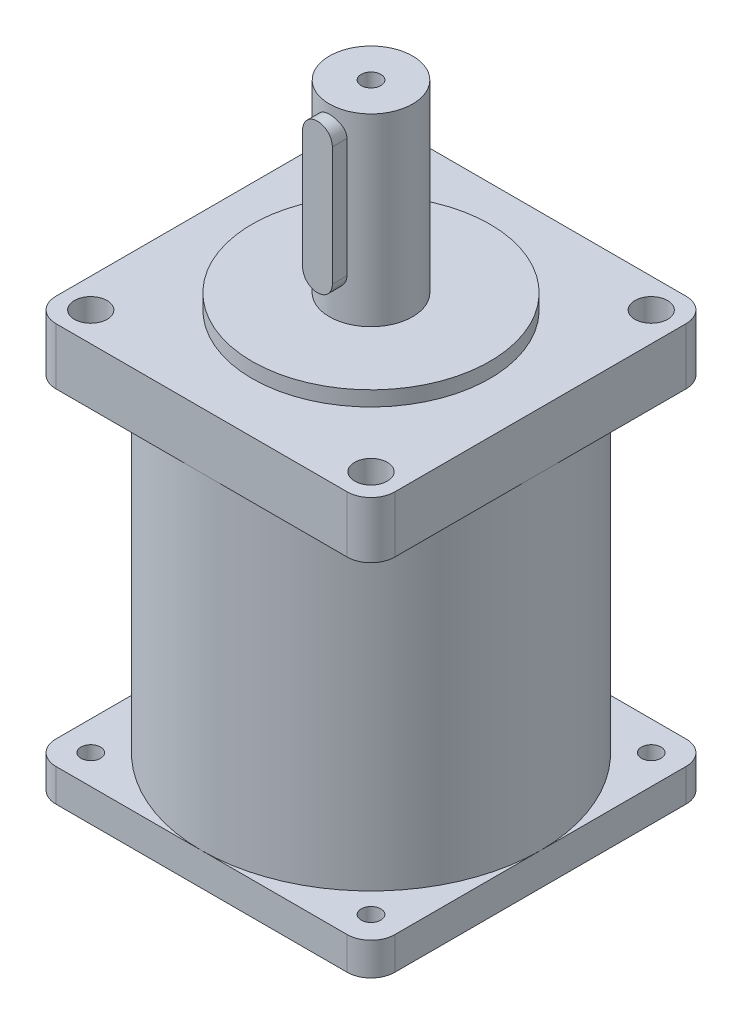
ISO-10303-21;
HEADER;
FILE_DESCRIPTION(('STEP AP214'),'2;1');
FILE_NAME('part.step','',(''),(''),'','','');
FILE_SCHEMA(('AUTOMOTIVE_DESIGN { 1 0 10303 214 1 1 1 1 }'));
ENDSEC;
DATA;
#1=APPLICATION_CONTEXT('core data for automotive mechanical design processes');
#2=APPLICATION_PROTOCOL_DEFINITION('international standard','automotive_design',2000,#1);
#3=PRODUCT_CONTEXT('',#1,'mechanical');
#4=PRODUCT('Part','Part','',(#3));
#5=PRODUCT_RELATED_PRODUCT_CATEGORY('part','',(#4));
#6=PRODUCT_DEFINITION_FORMATION('','',#4);
#7=PRODUCT_DEFINITION_CONTEXT('part definition',#1,'design');
#8=PRODUCT_DEFINITION('design','',#6,#7);
#9=PRODUCT_DEFINITION_SHAPE('','',#8);
#10=(LENGTH_UNIT() NAMED_UNIT(*) SI_UNIT(.MILLI.,.METRE.));
#11=(NAMED_UNIT(*) PLANE_ANGLE_UNIT() SI_UNIT($,.RADIAN.));
#12=(NAMED_UNIT(*) SI_UNIT($,.STERADIAN.) SOLID_ANGLE_UNIT());
#13=UNCERTAINTY_MEASURE_WITH_UNIT(LENGTH_MEASURE(1.E-05),#10,'distance_accuracy_value','');
#14=(GEOMETRIC_REPRESENTATION_CONTEXT(3) GLOBAL_UNCERTAINTY_ASSIGNED_CONTEXT((#13)) GLOBAL_UNIT_ASSIGNED_CONTEXT((#10,
#11,#12)) REPRESENTATION_CONTEXT('',''));
#15=CARTESIAN_POINT('',(0.,0.,0.));
#16=DIRECTION('',(0.,0.,1.));
#17=DIRECTION('',(1.,0.,0.));
#18=AXIS2_PLACEMENT_3D('',#15,#16,#17);
#19=CARTESIAN_POINT('',(0.,0.,0.));
#20=DIRECTION('',(0.,1.,0.));
#21=DIRECTION('',(0.,0.,1.));
#22=AXIS2_PLACEMENT_3D('',#19,#20,#21);
#23=PLANE('',#22);
#24=CARTESIAN_POINT('',(23.57,0.,23.57));
#25=DIRECTION('',(0.,1.,0.));
#26=DIRECTION('',(0.,0.,1.));
#27=AXIS2_PLACEMENT_3D('',#24,#25,#26);
#28=CIRCLE('',#27,2.75);
#29=CARTESIAN_POINT('',(23.57,0.,26.32));
#30=VERTEX_POINT('',#29);
#31=EDGE_CURVE('E602',#30,#30,#28,.T.);
#32=ORIENTED_EDGE('',*,*,#31,.T.);
#33=EDGE_LOOP('',(#32));
#34=FACE_BOUND('',#33,.T.);
#35=DIRECTION('',(0.,0.,-1.));
#36=VECTOR('',#35,1.);
#37=CARTESIAN_POINT('',(28.5,0.,-28.5));
#38=LINE('',#37,#36);
#39=CARTESIAN_POINT('',(28.5,0.,24.5));
#40=VERTEX_POINT('',#39);
#41=CARTESIAN_POINT('',(28.5,0.,0.));
#42=VERTEX_POINT('',#41);
#43=EDGE_CURVE('E578',#40,#42,#38,.T.);
#44=ORIENTED_EDGE('',*,*,#43,.F.);
#45=CARTESIAN_POINT('',(24.5,0.,24.5));
#46=DIRECTION('',(0.,1.,0.));
#47=DIRECTION('',(0.,0.,1.));
#48=AXIS2_PLACEMENT_3D('',#45,#46,#47);
#49=CIRCLE('',#48,4.);
#50=CARTESIAN_POINT('',(24.5,0.,28.5));
#51=VERTEX_POINT('',#50);
#52=EDGE_CURVE('E61',#40,#51,#49,.F.);
#53=ORIENTED_EDGE('',*,*,#52,.T.);
#54=DIRECTION('',(1.,0.,0.));
#55=VECTOR('',#54,1.);
#56=CARTESIAN_POINT('',(-28.5,0.,28.5));
#57=LINE('',#56,#55);
#58=CARTESIAN_POINT('',(0.,0.,28.5));
#59=VERTEX_POINT('',#58);
#60=EDGE_CURVE('E370',#59,#51,#57,.T.);
#61=ORIENTED_EDGE('',*,*,#60,.F.);
#62=CARTESIAN_POINT('',(0.,0.,0.));
#63=DIRECTION('',(0.,1.,0.));
#64=DIRECTION('',(0.,0.,1.));
#65=AXIS2_PLACEMENT_3D('',#62,#63,#64);
#66=CIRCLE('',#65,28.5);
#67=EDGE_CURVE('E246',#59,#42,#66,.T.);
#68=ORIENTED_EDGE('',*,*,#67,.T.);
#69=EDGE_LOOP('',(#44,#53,#61,#68));
#70=FACE_BOUND('',#69,.T.);
#71=ADVANCED_FACE('F39',(#34,#70),#23,.F.);
#72=CARTESIAN_POINT('',(23.57,0.,-23.57));
#73=DIRECTION('',(0.,1.,0.));
#74=DIRECTION('',(0.,0.,1.));
#75=AXIS2_PLACEMENT_3D('',#72,#73,#74);
#76=CIRCLE('',#75,2.75);
#77=CARTESIAN_POINT('',(23.57,0.,-20.82));
#78=VERTEX_POINT('',#77);
#79=EDGE_CURVE('E607',#78,#78,#76,.T.);
#80=ORIENTED_EDGE('',*,*,#79,.T.);
#81=EDGE_LOOP('',(#80));
#82=FACE_BOUND('',#81,.T.);
#83=DIRECTION('',(-1.,0.,0.));
#84=VECTOR('',#83,1.);
#85=CARTESIAN_POINT('',(-28.5,0.,-28.5));
#86=LINE('',#85,#84);
#87=CARTESIAN_POINT('',(24.5,0.,-28.5));
#88=VERTEX_POINT('',#87);
#89=CARTESIAN_POINT('',(0.,0.,-28.5));
#90=VERTEX_POINT('',#89);
#91=EDGE_CURVE('E375',#88,#90,#86,.T.);
#92=ORIENTED_EDGE('',*,*,#91,.F.);
#93=CARTESIAN_POINT('',(24.5,0.,-24.5));
#94=DIRECTION('',(0.,1.,0.));
#95=DIRECTION('',(0.,0.,1.));
#96=AXIS2_PLACEMENT_3D('',#93,#94,#95);
#97=CIRCLE('',#96,4.);
#98=CARTESIAN_POINT('',(28.5,0.,-24.5));
#99=VERTEX_POINT('',#98);
#100=EDGE_CURVE('E548',#88,#99,#97,.F.);
#101=ORIENTED_EDGE('',*,*,#100,.T.);
#102=EDGE_CURVE('E581',#42,#99,#38,.T.);
#103=ORIENTED_EDGE('',*,*,#102,.F.);
#104=EDGE_CURVE('E249',#42,#90,#66,.T.);
#105=ORIENTED_EDGE('',*,*,#104,.T.);
#106=EDGE_LOOP('',(#92,#101,#103,#105));
#107=FACE_BOUND('',#106,.T.);
#108=ADVANCED_FACE('F330',(#82,#107),#23,.F.);
#109=CARTESIAN_POINT('',(-23.57,0.,-23.57));
#110=DIRECTION('',(0.,1.,0.));
#111=DIRECTION('',(0.,0.,1.));
#112=AXIS2_PLACEMENT_3D('',#109,#110,#111);
#113=CIRCLE('',#112,2.75);
#114=CARTESIAN_POINT('',(-23.57,0.,-20.82));
#115=VERTEX_POINT('',#114);
#116=EDGE_CURVE('E360',#115,#115,#113,.T.);
#117=ORIENTED_EDGE('',*,*,#116,.T.);
#118=EDGE_LOOP('',(#117));
#119=FACE_BOUND('',#118,.T.);
#120=DIRECTION('',(0.,0.,1.));
#121=VECTOR('',#120,1.);
#122=CARTESIAN_POINT('',(-28.5,0.,-28.5));
#123=LINE('',#122,#121);
#124=CARTESIAN_POINT('',(-28.5,0.,-24.5));
#125=VERTEX_POINT('',#124);
#126=CARTESIAN_POINT('',(-28.5,0.,0.));
#127=VERTEX_POINT('',#126);
#128=EDGE_CURVE('E362',#125,#127,#123,.T.);
#129=ORIENTED_EDGE('',*,*,#128,.F.);
#130=CARTESIAN_POINT('',(-24.5,0.,-24.5));
#131=DIRECTION('',(0.,1.,0.));
#132=DIRECTION('',(0.,0.,1.));
#133=AXIS2_PLACEMENT_3D('',#130,#131,#132);
#134=CIRCLE('',#133,4.);
#135=CARTESIAN_POINT('',(-24.5,0.,-28.5));
#136=VERTEX_POINT('',#135);
#137=EDGE_CURVE('E364',#125,#136,#134,.F.);
#138=ORIENTED_EDGE('',*,*,#137,.T.);
#139=EDGE_CURVE('E580',#90,#136,#86,.T.);
#140=ORIENTED_EDGE('',*,*,#139,.F.);
#141=EDGE_CURVE('E258',#90,#127,#66,.T.);
#142=ORIENTED_EDGE('',*,*,#141,.T.);
#143=EDGE_LOOP('',(#129,#138,#140,#142));
#144=FACE_BOUND('',#143,.T.);
#145=ADVANCED_FACE('F336',(#119,#144),#23,.F.);
#146=CARTESIAN_POINT('',(0.,43.,0.));
#147=DIRECTION('',(0.,-1.,0.));
#148=DIRECTION('',(0.,0.,-1.));
#149=AXIS2_PLACEMENT_3D('',#146,#147,#148);
#150=CYLINDRICAL_SURFACE('',#149,7.);
#151=CARTESIAN_POINT('',(0.,43.,0.));
#152=DIRECTION('',(0.,1.,0.));
#153=DIRECTION('',(0.,0.,1.));
#154=AXIS2_PLACEMENT_3D('',#151,#152,#153);
#155=CIRCLE('',#154,7.);
#156=CARTESIAN_POINT('',(0.,43.,7.));
#157=VERTEX_POINT('',#156);
#158=EDGE_CURVE('E384',#157,#157,#155,.T.);
#159=ORIENTED_EDGE('',*,*,#158,.F.);
#160=EDGE_LOOP('',(#159));
#161=FACE_BOUND('',#160,.T.);
#162=CARTESIAN_POINT('',(0.,12.,0.));
#163=DIRECTION('',(0.,1.,0.));
#164=DIRECTION('',(0.,0.,1.));
#165=AXIS2_PLACEMENT_3D('',#162,#163,#164);
#166=CIRCLE('',#165,7.);
#167=CARTESIAN_POINT('',(0.,12.,7.));
#168=VERTEX_POINT('',#167);
#169=EDGE_CURVE('E380',#168,#168,#166,.F.);
#170=ORIENTED_EDGE('',*,*,#169,.F.);
#171=EDGE_LOOP('',(#170));
#172=FACE_BOUND('',#171,.T.);
#173=CARTESIAN_POINT('',(-2.5,39.,6.53834841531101));
#174=CARTESIAN_POINT('',(-2.50000293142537,38.8644729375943,6.53834584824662));
#175=CARTESIAN_POINT('',(-2.48894249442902,38.7289661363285,6.54260813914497));
#176=CARTESIAN_POINT('',(-2.44517096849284,38.4620070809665,6.55909115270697));
#177=CARTESIAN_POINT('',(-2.41245881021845,38.3305550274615,6.57131226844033));
#178=CARTESIAN_POINT('',(-2.32671186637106,38.0756252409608,6.60215581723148));
#179=CARTESIAN_POINT('',(-2.27372177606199,37.9521306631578,6.62076416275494));
#180=CARTESIAN_POINT('',(-2.14907922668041,37.7157391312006,6.66226377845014));
#181=CARTESIAN_POINT('',(-2.0774217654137,37.6028450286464,6.68515619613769));
#182=CARTESIAN_POINT('',(-1.91402447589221,37.3857788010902,6.73379932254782));
#183=CARTESIAN_POINT('',(-1.82158324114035,37.2821521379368,6.75962863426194));
#184=CARTESIAN_POINT('',(-1.62073451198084,37.0914931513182,6.81057580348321));
#185=CARTESIAN_POINT('',(-1.51232401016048,37.004463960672,6.8356935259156));
#186=CARTESIAN_POINT('',(-1.27854087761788,36.8469109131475,6.88331097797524));
#187=CARTESIAN_POINT('',(-1.15275218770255,36.7769705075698,6.90570766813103));
#188=CARTESIAN_POINT('',(-0.890255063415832,36.6594649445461,6.94442306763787));
#189=CARTESIAN_POINT('',(-0.753550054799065,36.6118927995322,6.9607436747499));
#190=CARTESIAN_POINT('',(-0.478828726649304,36.5423590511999,6.98491061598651));
#191=CARTESIAN_POINT('',(-0.34107728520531,36.5194604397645,6.99306609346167));
#192=CARTESIAN_POINT('',(-0.0634617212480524,36.4969316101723,7.00108797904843));
#193=CARTESIAN_POINT('',(0.0764017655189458,36.4972945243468,7.0009568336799));
#194=CARTESIAN_POINT('',(0.347592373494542,36.5207111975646,6.99262260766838));
#195=CARTESIAN_POINT('',(0.479020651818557,36.5427445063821,6.98478254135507));
#196=CARTESIAN_POINT('',(0.736174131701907,36.6071728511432,6.96237851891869));
#197=CARTESIAN_POINT('',(0.861898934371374,36.6495693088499,6.94781409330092));
#198=CARTESIAN_POINT('',(1.10616096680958,36.7540469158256,6.91316507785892));
#199=CARTESIAN_POINT('',(1.22457268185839,36.8163957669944,6.89300594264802));
#200=CARTESIAN_POINT('',(1.44953519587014,36.9587791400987,6.84923357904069));
#201=CARTESIAN_POINT('',(1.55608236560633,37.0388190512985,6.82561929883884));
#202=CARTESIAN_POINT('',(1.76033248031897,37.2193307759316,6.77590353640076));
#203=CARTESIAN_POINT('',(1.85725678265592,37.3206669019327,6.74973657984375));
#204=CARTESIAN_POINT('',(2.03301110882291,37.5383434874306,6.69889962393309));
#205=CARTESIAN_POINT('',(2.11183741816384,37.6546870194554,6.67422993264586));
#206=CARTESIAN_POINT('',(2.25045901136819,37.9018776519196,6.62879124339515));
#207=CARTESIAN_POINT('',(2.30987563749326,38.0329530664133,6.6081027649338));
#208=CARTESIAN_POINT('',(2.40551106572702,38.304179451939,6.57389739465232));
#209=CARTESIAN_POINT('',(2.44174134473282,38.4443258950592,6.56037695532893));
#210=CARTESIAN_POINT('',(2.48828716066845,38.7220838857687,6.54286005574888));
#211=CARTESIAN_POINT('',(2.49982704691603,38.859461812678,6.53841416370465));
#212=CARTESIAN_POINT('',(2.50016897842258,39.1342333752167,6.53828418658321));
#213=CARTESIAN_POINT('',(2.48897597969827,39.2716270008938,6.54259819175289));
#214=CARTESIAN_POINT('',(2.44527599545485,39.5365737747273,6.55904904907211));
#215=CARTESIAN_POINT('',(2.41367185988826,39.6642987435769,6.57085417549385));
#216=CARTESIAN_POINT('',(2.33115923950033,39.9125899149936,6.60057618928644));
#217=CARTESIAN_POINT('',(2.2802470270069,40.0331547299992,6.6184942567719));
#218=CARTESIAN_POINT('',(2.15854403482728,40.2684001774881,6.65919897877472));
#219=CARTESIAN_POINT('',(2.08711845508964,40.3827259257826,6.68213439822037));
#220=CARTESIAN_POINT('',(1.92711056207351,40.598207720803,6.73002297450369));
#221=CARTESIAN_POINT('',(1.83852249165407,40.6993593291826,6.75497680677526));
#222=CARTESIAN_POINT('',(1.64077043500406,40.8915426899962,6.80579566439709));
#223=CARTESIAN_POINT('',(1.53072651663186,40.9816793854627,6.83163247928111));
#224=CARTESIAN_POINT('',(1.29643714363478,41.1422926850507,6.87993729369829));
#225=CARTESIAN_POINT('',(1.1721919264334,41.2127696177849,6.90240534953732));
#226=CARTESIAN_POINT('',(0.91338047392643,41.3315002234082,6.94137984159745));
#227=CARTESIAN_POINT('',(0.778870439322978,41.3798660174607,6.95791626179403));
#228=CARTESIAN_POINT('',(0.502906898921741,41.4530468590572,6.9832833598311));
#229=CARTESIAN_POINT('',(0.361456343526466,41.4778718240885,6.99211728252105));
#230=CARTESIAN_POINT('',(0.0837575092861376,41.5022729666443,7.0008038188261));
#231=CARTESIAN_POINT('',(-0.0523654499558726,41.5031261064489,7.00111065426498));
#232=CARTESIAN_POINT('',(-0.322726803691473,41.4827846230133,6.99386365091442));
#233=CARTESIAN_POINT('',(-0.456965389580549,41.4615922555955,6.98631061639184));
#234=CARTESIAN_POINT('',(-0.716981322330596,41.3986398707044,6.96438311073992));
#235=CARTESIAN_POINT('',(-0.842875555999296,41.3573092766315,6.95015128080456));
#236=CARTESIAN_POINT('',(-1.08597143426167,41.2556669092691,6.91633887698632));
#237=CARTESIAN_POINT('',(-1.20317144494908,41.1953515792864,6.8967573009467));
#238=CARTESIAN_POINT('',(-1.43068233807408,41.0546886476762,6.85325490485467));
#239=CARTESIAN_POINT('',(-1.54052934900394,40.9736355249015,6.82919171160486));
#240=CARTESIAN_POINT('',(-1.74546847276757,40.7949475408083,6.77971046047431));
#241=CARTESIAN_POINT('',(-1.84055552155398,40.6973070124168,6.75429194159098));
#242=CARTESIAN_POINT('',(-2.01782220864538,40.4827811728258,6.70352883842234));
#243=CARTESIAN_POINT('',(-2.09919180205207,40.3652101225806,6.67824313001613));
#244=CARTESIAN_POINT('',(-2.24100798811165,40.1172615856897,6.63200351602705));
#245=CARTESIAN_POINT('',(-2.30145599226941,39.9868849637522,6.61104931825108));
#246=CARTESIAN_POINT('',(-2.39953333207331,39.7162590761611,6.57609213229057));
#247=CARTESIAN_POINT('',(-2.43706721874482,39.5759711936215,6.56211826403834));
#248=CARTESIAN_POINT('',(-2.48729274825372,39.2904461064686,6.54325005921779));
#249=CARTESIAN_POINT('',(-2.4999968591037,39.1452114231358,6.53835116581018));
#250=CARTESIAN_POINT('',(-2.5,39.,6.53834841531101));
#251=B_SPLINE_CURVE_WITH_KNOTS('',3,(#173,#174,#175,#176,#177,#178,#179,#180,#181,#182,#183,
#184,#185,#186,#187,#188,#189,#190,#191,#192,#193,#194,#195,#196,#197,#198,#199,#200,#201,#202,
#203,#204,#205,#206,#207,#208,#209,#210,#211,#212,#213,#214,#215,#216,#217,#218,#219,#220,#221,
#222,#223,#224,#225,#226,#227,#228,#229,#230,#231,#232,#233,#234,#235,#236,#237,#238,#239,#240,
#241,#242,#243,#244,#245,#246,#247,#248,#249,#250),.UNSPECIFIED.,.T.,.F.,(4,2,2,2,2,2,2,2,2,2,2,
2,2,2,2,2,2,2,2,2,2,2,2,2,2,2,2,2,2,2,2,2,2,2,2,2,2,2,4),(0.,0.406041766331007,
0.812103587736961,1.21727550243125,1.62255610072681,2.04441002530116,2.46634349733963,
2.90112813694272,3.33577686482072,3.75326460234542,4.17062908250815,4.56923737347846,
4.96787349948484,5.37209971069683,5.77644923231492,6.20244167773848,6.62852147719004,
7.06247609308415,7.4962157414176,7.90789453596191,8.31948358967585,8.71400941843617,
9.10861145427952,9.5170588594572,9.92564351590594,10.3573204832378,10.7889902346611,
11.2184461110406,11.6477209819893,12.0540827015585,12.4604028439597,12.8584146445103,
13.2565010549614,13.67053016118,14.0847010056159,14.5182116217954,14.9516929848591,
15.386967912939,15.8220242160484),.UNSPECIFIED.);
#252=CARTESIAN_POINT('',(2.5,39.,6.53834841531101));
#253=VERTEX_POINT('',#252);
#254=CARTESIAN_POINT('',(-2.5,39.,6.53834841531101));
#255=VERTEX_POINT('',#254);
#256=EDGE_CURVE('E260',#253,#255,#251,.T.);
#257=ORIENTED_EDGE('',*,*,#256,.F.);
#258=DIRECTION('',(0.,-1.,0.));
#259=VECTOR('',#258,1.);
#260=CARTESIAN_POINT('',(2.5,43.,6.53834841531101));
#261=LINE('',#260,#259);
#262=CARTESIAN_POINT('',(2.5,19.,6.53834841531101));
#263=VERTEX_POINT('',#262);
#264=EDGE_CURVE('E385',#263,#253,#261,.F.);
#265=ORIENTED_EDGE('',*,*,#264,.F.);
#266=CARTESIAN_POINT('',(-2.5,19.,6.53834841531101));
#267=CARTESIAN_POINT('',(-2.50000293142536,18.8644729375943,6.53834584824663));
#268=CARTESIAN_POINT('',(-2.48894249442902,18.7289661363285,6.54260813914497));
#269=CARTESIAN_POINT('',(-2.44517096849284,18.4620070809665,6.55909115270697));
#270=CARTESIAN_POINT('',(-2.41245881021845,18.3305550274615,6.57131226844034));
#271=CARTESIAN_POINT('',(-2.32671186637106,18.0756252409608,6.60215581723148));
#272=CARTESIAN_POINT('',(-2.27372177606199,17.9521306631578,6.62076416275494));
#273=CARTESIAN_POINT('',(-2.14907922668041,17.7157391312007,6.66226377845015));
#274=CARTESIAN_POINT('',(-2.0774217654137,17.6028450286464,6.68515619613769));
#275=CARTESIAN_POINT('',(-1.91402447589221,17.3857788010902,6.73379932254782));
#276=CARTESIAN_POINT('',(-1.82158324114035,17.2821521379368,6.75962863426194));
#277=CARTESIAN_POINT('',(-1.62073451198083,17.0914931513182,6.81057580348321));
#278=CARTESIAN_POINT('',(-1.51232401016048,17.004463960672,6.8356935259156));
#279=CARTESIAN_POINT('',(-1.27854087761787,16.8469109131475,6.88331097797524));
#280=CARTESIAN_POINT('',(-1.15275218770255,16.7769705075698,6.90570766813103));
#281=CARTESIAN_POINT('',(-0.890255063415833,16.6594649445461,6.94442306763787));
#282=CARTESIAN_POINT('',(-0.753550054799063,16.6118927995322,6.9607436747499));
#283=CARTESIAN_POINT('',(-0.478828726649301,16.5423590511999,6.98491061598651));
#284=CARTESIAN_POINT('',(-0.341077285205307,16.5194604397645,6.99306609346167));
#285=CARTESIAN_POINT('',(-0.0634617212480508,16.4969316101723,7.00108797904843));
#286=CARTESIAN_POINT('',(0.0764017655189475,16.4972945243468,7.0009568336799));
#287=CARTESIAN_POINT('',(0.347592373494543,16.5207111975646,6.99262260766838));
#288=CARTESIAN_POINT('',(0.479020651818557,16.5427445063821,6.98478254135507));
#289=CARTESIAN_POINT('',(0.736174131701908,16.6071728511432,6.96237851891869));
#290=CARTESIAN_POINT('',(0.861898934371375,16.6495693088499,6.94781409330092));
#291=CARTESIAN_POINT('',(1.10616096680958,16.7540469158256,6.91316507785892));
#292=CARTESIAN_POINT('',(1.22457268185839,16.8163957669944,6.89300594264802));
#293=CARTESIAN_POINT('',(1.44953519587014,16.9587791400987,6.84923357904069));
#294=CARTESIAN_POINT('',(1.55608236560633,17.0388190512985,6.82561929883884));
#295=CARTESIAN_POINT('',(1.76033248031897,17.2193307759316,6.77590353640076));
#296=CARTESIAN_POINT('',(1.85725678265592,17.3206669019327,6.74973657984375));
#297=CARTESIAN_POINT('',(2.03301110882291,17.5383434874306,6.69889962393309));
#298=CARTESIAN_POINT('',(2.11183741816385,17.6546870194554,6.67422993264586));
#299=CARTESIAN_POINT('',(2.25045901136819,17.9018776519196,6.62879124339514));
#300=CARTESIAN_POINT('',(2.30987563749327,18.0329530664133,6.6081027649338));
#301=CARTESIAN_POINT('',(2.40551106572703,18.304179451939,6.57389739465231));
#302=CARTESIAN_POINT('',(2.44174134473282,18.4443258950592,6.56037695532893));
#303=CARTESIAN_POINT('',(2.48828716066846,18.7220838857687,6.54286005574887));
#304=CARTESIAN_POINT('',(2.49982704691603,18.859461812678,6.53841416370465));
#305=CARTESIAN_POINT('',(2.50016897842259,19.1342333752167,6.53828418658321));
#306=CARTESIAN_POINT('',(2.48897597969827,19.2716270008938,6.54259819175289));
#307=CARTESIAN_POINT('',(2.44527599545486,19.5365737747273,6.55904904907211));
#308=CARTESIAN_POINT('',(2.41367185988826,19.6642987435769,6.57085417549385));
#309=CARTESIAN_POINT('',(2.33115923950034,19.9125899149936,6.60057618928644));
#310=CARTESIAN_POINT('',(2.2802470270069,20.0331547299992,6.6184942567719));
#311=CARTESIAN_POINT('',(2.15854403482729,20.2684001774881,6.65919897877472));
#312=CARTESIAN_POINT('',(2.08711845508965,20.3827259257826,6.68213439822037));
#313=CARTESIAN_POINT('',(1.92711056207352,20.598207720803,6.73002297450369));
#314=CARTESIAN_POINT('',(1.83852249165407,20.6993593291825,6.75497680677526));
#315=CARTESIAN_POINT('',(1.64077043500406,20.8915426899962,6.80579566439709));
#316=CARTESIAN_POINT('',(1.53072651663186,20.9816793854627,6.83163247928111));
#317=CARTESIAN_POINT('',(1.29643714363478,21.1422926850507,6.87993729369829));
#318=CARTESIAN_POINT('',(1.17219192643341,21.2127696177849,6.90240534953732));
#319=CARTESIAN_POINT('',(0.913380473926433,21.3315002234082,6.94137984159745));
#320=CARTESIAN_POINT('',(0.778870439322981,21.3798660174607,6.95791626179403));
#321=CARTESIAN_POINT('',(0.502906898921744,21.4530468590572,6.9832833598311));
#322=CARTESIAN_POINT('',(0.361456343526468,21.4778718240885,6.99211728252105));
#323=CARTESIAN_POINT('',(0.0837575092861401,21.5022729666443,7.0008038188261));
#324=CARTESIAN_POINT('',(-0.0523654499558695,21.5031261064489,7.00111065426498));
#325=CARTESIAN_POINT('',(-0.322726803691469,21.4827846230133,6.99386365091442));
#326=CARTESIAN_POINT('',(-0.456965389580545,21.4615922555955,6.98631061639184));
#327=CARTESIAN_POINT('',(-0.716981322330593,21.3986398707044,6.96438311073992));
#328=CARTESIAN_POINT('',(-0.842875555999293,21.3573092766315,6.95015128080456));
#329=CARTESIAN_POINT('',(-1.08597143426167,21.2556669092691,6.91633887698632));
#330=CARTESIAN_POINT('',(-1.20317144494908,21.1953515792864,6.8967573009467));
#331=CARTESIAN_POINT('',(-1.43068233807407,21.0546886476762,6.85325490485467));
#332=CARTESIAN_POINT('',(-1.54052934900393,20.9736355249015,6.82919171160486));
#333=CARTESIAN_POINT('',(-1.74546847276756,20.7949475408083,6.77971046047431));
#334=CARTESIAN_POINT('',(-1.84055552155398,20.6973070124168,6.75429194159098));
#335=CARTESIAN_POINT('',(-2.01782220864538,20.4827811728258,6.70352883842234));
#336=CARTESIAN_POINT('',(-2.09919180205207,20.3652101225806,6.67824313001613));
#337=CARTESIAN_POINT('',(-2.24100798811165,20.1172615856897,6.63200351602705));
#338=CARTESIAN_POINT('',(-2.30145599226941,19.9868849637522,6.61104931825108));
#339=CARTESIAN_POINT('',(-2.39953333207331,19.7162590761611,6.57609213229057));
#340=CARTESIAN_POINT('',(-2.43706721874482,19.5759711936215,6.56211826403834));
#341=CARTESIAN_POINT('',(-2.48729274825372,19.2904461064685,6.54325005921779));
#342=CARTESIAN_POINT('',(-2.49999685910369,19.1452114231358,6.53835116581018));
#343=CARTESIAN_POINT('',(-2.5,19.,6.53834841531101));
#344=B_SPLINE_CURVE_WITH_KNOTS('',3,(#266,#267,#268,#269,#270,#271,#272,#273,#274,#275,#276,
#277,#278,#279,#280,#281,#282,#283,#284,#285,#286,#287,#288,#289,#290,#291,#292,#293,#294,#295,
#296,#297,#298,#299,#300,#301,#302,#303,#304,#305,#306,#307,#308,#309,#310,#311,#312,#313,#314,
#315,#316,#317,#318,#319,#320,#321,#322,#323,#324,#325,#326,#327,#328,#329,#330,#331,#332,#333,
#334,#335,#336,#337,#338,#339,#340,#341,#342,#343),.UNSPECIFIED.,.T.,.F.,(4,2,2,2,2,2,2,2,2,2,2,
2,2,2,2,2,2,2,2,2,2,2,2,2,2,2,2,2,2,2,2,2,2,2,2,2,2,2,4),(0.,0.406041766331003,
0.812103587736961,1.21727550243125,1.62255610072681,2.04441002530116,2.46634349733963,
2.90112813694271,3.33577686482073,3.75326460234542,4.17062908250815,4.56923737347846,
4.96787349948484,5.37209971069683,5.77644923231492,6.20244167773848,6.62852147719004,
7.06247609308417,7.4962157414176,7.90789453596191,8.31948358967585,8.71400941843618,
9.10861145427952,9.5170588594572,9.92564351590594,10.3573204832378,10.7889902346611,
11.2184461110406,11.6477209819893,12.0540827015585,12.4604028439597,12.8584146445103,
13.2565010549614,13.67053016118,14.0847010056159,14.5182116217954,14.9516929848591,
15.386967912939,15.8220242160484),.UNSPECIFIED.);
#345=CARTESIAN_POINT('',(-2.5,19.,6.53834841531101));
#346=VERTEX_POINT('',#345);
#347=EDGE_CURVE('E274',#346,#263,#344,.T.);
#348=ORIENTED_EDGE('',*,*,#347,.F.);
#349=DIRECTION('',(0.,-1.,0.));
#350=VECTOR('',#349,1.);
#351=CARTESIAN_POINT('',(-2.5,43.,6.53834841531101));
#352=LINE('',#351,#350);
#353=EDGE_CURVE('E267',#255,#346,#352,.T.);
#354=ORIENTED_EDGE('',*,*,#353,.F.);
#355=EDGE_LOOP('',(#257,#265,#348,#354));
#356=FACE_BOUND('',#355,.T.);
#357=ADVANCED_FACE('F283',(#161,#172,#356),#150,.T.);
#358=CARTESIAN_POINT('',(0.,12.,0.));
#359=DIRECTION('',(0.,1.,0.));
#360=DIRECTION('',(0.,0.,1.));
#361=AXIS2_PLACEMENT_3D('',#358,#359,#360);
#362=PLANE('',#361);
#363=CARTESIAN_POINT('',(0.,12.,0.));
#364=DIRECTION('',(0.,1.,0.));
#365=DIRECTION('',(0.,0.,1.));
#366=AXIS2_PLACEMENT_3D('',#363,#364,#365);
#367=CIRCLE('',#366,20.);
#368=CARTESIAN_POINT('',(0.,12.,20.));
#369=VERTEX_POINT('',#368);
#370=EDGE_CURVE('E582',#369,#369,#367,.T.);
#371=ORIENTED_EDGE('',*,*,#370,.T.);
#372=EDGE_LOOP('',(#371));
#373=FACE_BOUND('',#372,.T.);
#374=ORIENTED_EDGE('',*,*,#169,.T.);
#375=EDGE_LOOP('',(#374));
#376=FACE_BOUND('',#375,.T.);
#377=ADVANCED_FACE('F355',(#373,#376),#362,.T.);
#378=CARTESIAN_POINT('',(0.,9.5,0.));
#379=DIRECTION('',(0.,1.,0.));
#380=DIRECTION('',(0.,0.,1.));
#381=AXIS2_PLACEMENT_3D('',#378,#379,#380);
#382=PLANE('',#381);
#383=CARTESIAN_POINT('',(23.57,9.5,-23.57));
#384=DIRECTION('',(0.,1.,0.));
#385=DIRECTION('',(0.,0.,1.));
#386=AXIS2_PLACEMENT_3D('',#383,#384,#385);
#387=CIRCLE('',#386,2.75);
#388=CARTESIAN_POINT('',(23.57,9.5,-20.82));
#389=VERTEX_POINT('',#388);
#390=EDGE_CURVE('E609',#389,#389,#387,.T.);
#391=ORIENTED_EDGE('',*,*,#390,.F.);
#392=EDGE_LOOP('',(#391));
#393=FACE_BOUND('',#392,.T.);
#394=CARTESIAN_POINT('',(23.57,9.5,23.57));
#395=DIRECTION('',(0.,1.,0.));
#396=DIRECTION('',(0.,0.,1.));
#397=AXIS2_PLACEMENT_3D('',#394,#395,#396);
#398=CIRCLE('',#397,2.75);
#399=CARTESIAN_POINT('',(23.57,9.5,26.32));
#400=VERTEX_POINT('',#399);
#401=EDGE_CURVE('E604',#400,#400,#398,.T.);
#402=ORIENTED_EDGE('',*,*,#401,.F.);
#403=EDGE_LOOP('',(#402));
#404=FACE_BOUND('',#403,.T.);
#405=CARTESIAN_POINT('',(-23.57,9.5,23.57));
#406=DIRECTION('',(0.,1.,0.));
#407=DIRECTION('',(0.,0.,1.));
#408=AXIS2_PLACEMENT_3D('',#405,#406,#407);
#409=CIRCLE('',#408,2.75);
#410=CARTESIAN_POINT('',(-23.57,9.5,26.32));
#411=VERTEX_POINT('',#410);
#412=EDGE_CURVE('E599',#411,#411,#409,.T.);
#413=ORIENTED_EDGE('',*,*,#412,.F.);
#414=EDGE_LOOP('',(#413));
#415=FACE_BOUND('',#414,.T.);
#416=CARTESIAN_POINT('',(-23.57,9.5,-23.57));
#417=DIRECTION('',(0.,1.,0.));
#418=DIRECTION('',(0.,0.,1.));
#419=AXIS2_PLACEMENT_3D('',#416,#417,#418);
#420=CIRCLE('',#419,2.75);
#421=CARTESIAN_POINT('',(-23.57,9.5,-20.82));
#422=VERTEX_POINT('',#421);
#423=EDGE_CURVE('E594',#422,#422,#420,.T.);
#424=ORIENTED_EDGE('',*,*,#423,.F.);
#425=EDGE_LOOP('',(#424));
#426=FACE_BOUND('',#425,.T.);
#427=DIRECTION('',(-1.,0.,0.));
#428=VECTOR('',#427,1.);
#429=CARTESIAN_POINT('',(-28.5,9.5,-28.5));
#430=LINE('',#429,#428);
#431=CARTESIAN_POINT('',(24.5,9.5,-28.5));
#432=VERTEX_POINT('',#431);
#433=CARTESIAN_POINT('',(-24.5,9.5,-28.5));
#434=VERTEX_POINT('',#433);
#435=EDGE_CURVE('E585',#432,#434,#430,.T.);
#436=ORIENTED_EDGE('',*,*,#435,.T.);
#437=CARTESIAN_POINT('',(-24.5,9.5,-24.5));
#438=DIRECTION('',(0.,1.,0.));
#439=DIRECTION('',(0.,0.,1.));
#440=AXIS2_PLACEMENT_3D('',#437,#438,#439);
#441=CIRCLE('',#440,4.);
#442=CARTESIAN_POINT('',(-28.5,9.5,-24.5));
#443=VERTEX_POINT('',#442);
#444=EDGE_CURVE('E546',#434,#443,#441,.T.);
#445=ORIENTED_EDGE('',*,*,#444,.T.);
#446=DIRECTION('',(0.,0.,1.));
#447=VECTOR('',#446,1.);
#448=CARTESIAN_POINT('',(-28.5,9.5,-28.5));
#449=LINE('',#448,#447);
#450=CARTESIAN_POINT('',(-28.5,9.5,24.5));
#451=VERTEX_POINT('',#450);
#452=EDGE_CURVE('E571',#443,#451,#449,.T.);
#453=ORIENTED_EDGE('',*,*,#452,.T.);
#454=CARTESIAN_POINT('',(-24.5,9.5,24.5));
#455=DIRECTION('',(0.,1.,0.));
#456=DIRECTION('',(0.,0.,1.));
#457=AXIS2_PLACEMENT_3D('',#454,#455,#456);
#458=CIRCLE('',#457,4.);
#459=CARTESIAN_POINT('',(-24.5,9.5,28.5));
#460=VERTEX_POINT('',#459);
#461=EDGE_CURVE('E540',#451,#460,#458,.T.);
#462=ORIENTED_EDGE('',*,*,#461,.T.);
#463=DIRECTION('',(1.,0.,0.));
#464=VECTOR('',#463,1.);
#465=CARTESIAN_POINT('',(-28.5,9.5,28.5));
#466=LINE('',#465,#464);
#467=CARTESIAN_POINT('',(24.5,9.5,28.5));
#468=VERTEX_POINT('',#467);
#469=EDGE_CURVE('E387',#460,#468,#466,.T.);
#470=ORIENTED_EDGE('',*,*,#469,.T.);
#471=CARTESIAN_POINT('',(24.5,9.5,24.5));
#472=DIRECTION('',(0.,1.,0.));
#473=DIRECTION('',(0.,0.,1.));
#474=AXIS2_PLACEMENT_3D('',#471,#472,#473);
#475=CIRCLE('',#474,4.);
#476=CARTESIAN_POINT('',(28.5,9.5,24.5));
#477=VERTEX_POINT('',#476);
#478=EDGE_CURVE('E542',#468,#477,#475,.T.);
#479=ORIENTED_EDGE('',*,*,#478,.T.);
#480=DIRECTION('',(0.,0.,-1.));
#481=VECTOR('',#480,1.);
#482=CARTESIAN_POINT('',(28.5,9.5,-28.5));
#483=LINE('',#482,#481);
#484=CARTESIAN_POINT('',(28.5,9.5,-24.5));
#485=VERTEX_POINT('',#484);
#486=EDGE_CURVE('E379',#477,#485,#483,.T.);
#487=ORIENTED_EDGE('',*,*,#486,.T.);
#488=CARTESIAN_POINT('',(24.5,9.5,-24.5));
#489=DIRECTION('',(0.,1.,0.));
#490=DIRECTION('',(0.,0.,1.));
#491=AXIS2_PLACEMENT_3D('',#488,#489,#490);
#492=CIRCLE('',#491,4.);
#493=EDGE_CURVE('E544',#485,#432,#492,.T.);
#494=ORIENTED_EDGE('',*,*,#493,.T.);
#495=EDGE_LOOP('',(#436,#445,#453,#462,#470,#479,#487,#494));
#496=FACE_BOUND('',#495,.T.);
#497=CARTESIAN_POINT('',(0.,9.5,0.));
#498=DIRECTION('',(0.,1.,0.));
#499=DIRECTION('',(0.,0.,1.));
#500=AXIS2_PLACEMENT_3D('',#497,#498,#499);
#501=CIRCLE('',#500,20.);
#502=CARTESIAN_POINT('',(0.,9.5,20.));
#503=VERTEX_POINT('',#502);
#504=EDGE_CURVE('E383',#503,#503,#501,.T.);
#505=ORIENTED_EDGE('',*,*,#504,.F.);
#506=EDGE_LOOP('',(#505));
#507=FACE_BOUND('',#506,.T.);
#508=ADVANCED_FACE('F565',(#393,#404,#415,#426,#496,#507),#382,.T.);
#509=CARTESIAN_POINT('',(28.5,9.5,-28.5));
#510=DIRECTION('',(-1.,0.,0.));
#511=DIRECTION('',(0.,0.,1.));
#512=AXIS2_PLACEMENT_3D('',#509,#510,#511);
#513=PLANE('',#512);
#514=ORIENTED_EDGE('',*,*,#102,.T.);
#515=DIRECTION('',(0.,-1.,0.));
#516=VECTOR('',#515,1.);
#517=CARTESIAN_POINT('',(28.5,9.5,-24.5));
#518=LINE('',#517,#516);
#519=EDGE_CURVE('E553',#99,#485,#518,.F.);
#520=ORIENTED_EDGE('',*,*,#519,.T.);
#521=ORIENTED_EDGE('',*,*,#486,.F.);
#522=DIRECTION('',(0.,-1.,0.));
#523=VECTOR('',#522,1.);
#524=CARTESIAN_POINT('',(28.5,9.5,24.5));
#525=LINE('',#524,#523);
#526=EDGE_CURVE('E550',#477,#40,#525,.T.);
#527=ORIENTED_EDGE('',*,*,#526,.T.);
#528=ORIENTED_EDGE('',*,*,#43,.T.);
#529=EDGE_LOOP('',(#514,#520,#521,#527,#528));
#530=FACE_BOUND('',#529,.T.);
#531=ADVANCED_FACE('F577',(#530),#513,.F.);
#532=CARTESIAN_POINT('',(-28.5,9.5,-28.5));
#533=DIRECTION('',(0.,0.,1.));
#534=DIRECTION('',(1.,0.,0.));
#535=AXIS2_PLACEMENT_3D('',#532,#533,#534);
#536=PLANE('',#535);
#537=ORIENTED_EDGE('',*,*,#139,.T.);
#538=DIRECTION('',(0.,-1.,0.));
#539=VECTOR('',#538,1.);
#540=CARTESIAN_POINT('',(-24.5,9.5,-28.5));
#541=LINE('',#540,#539);
#542=EDGE_CURVE('E538',#136,#434,#541,.F.);
#543=ORIENTED_EDGE('',*,*,#542,.T.);
#544=ORIENTED_EDGE('',*,*,#435,.F.);
#545=DIRECTION('',(0.,-1.,0.));
#546=VECTOR('',#545,1.);
#547=CARTESIAN_POINT('',(24.5,9.5,-28.5));
#548=LINE('',#547,#546);
#549=EDGE_CURVE('E535',#432,#88,#548,.T.);
#550=ORIENTED_EDGE('',*,*,#549,.T.);
#551=ORIENTED_EDGE('',*,*,#91,.T.);
#552=EDGE_LOOP('',(#537,#543,#544,#550,#551));
#553=FACE_BOUND('',#552,.T.);
#554=ADVANCED_FACE('F952',(#553),#536,.F.);
#555=CARTESIAN_POINT('',(-28.5,9.5,-28.5));
#556=DIRECTION('',(1.,0.,0.));
#557=DIRECTION('',(0.,0.,-1.));
#558=AXIS2_PLACEMENT_3D('',#555,#556,#557);
#559=PLANE('',#558);
#560=ORIENTED_EDGE('',*,*,#452,.F.);
#561=DIRECTION('',(0.,-1.,0.));
#562=VECTOR('',#561,1.);
#563=CARTESIAN_POINT('',(-28.5,9.5,-24.5));
#564=LINE('',#563,#562);
#565=EDGE_CURVE('E532',#443,#125,#564,.T.);
#566=ORIENTED_EDGE('',*,*,#565,.T.);
#567=ORIENTED_EDGE('',*,*,#128,.T.);
#568=CARTESIAN_POINT('',(-28.5,0.,24.5));
#569=VERTEX_POINT('',#568);
#570=EDGE_CURVE('E371',#127,#569,#123,.T.);
#571=ORIENTED_EDGE('',*,*,#570,.T.);
#572=DIRECTION('',(0.,-1.,0.));
#573=VECTOR('',#572,1.);
#574=CARTESIAN_POINT('',(-28.5,9.5,24.5));
#575=LINE('',#574,#573);
#576=EDGE_CURVE('E526',#569,#451,#575,.F.);
#577=ORIENTED_EDGE('',*,*,#576,.T.);
#578=EDGE_LOOP('',(#560,#566,#567,#571,#577));
#579=FACE_BOUND('',#578,.T.);
#580=ADVANCED_FACE('F347',(#579),#559,.F.);
#581=CARTESIAN_POINT('',(-28.5,9.5,28.5));
#582=DIRECTION('',(0.,0.,-1.));
#583=DIRECTION('',(-1.,0.,0.));
#584=AXIS2_PLACEMENT_3D('',#581,#582,#583);
#585=PLANE('',#584);
#586=ORIENTED_EDGE('',*,*,#60,.T.);
#587=DIRECTION('',(0.,-1.,0.));
#588=VECTOR('',#587,1.);
#589=CARTESIAN_POINT('',(24.5,9.5,28.5));
#590=LINE('',#589,#588);
#591=EDGE_CURVE('E48',#51,#468,#590,.F.);
#592=ORIENTED_EDGE('',*,*,#591,.T.);
#593=ORIENTED_EDGE('',*,*,#469,.F.);
#594=DIRECTION('',(0.,-1.,0.));
#595=VECTOR('',#594,1.);
#596=CARTESIAN_POINT('',(-24.5,9.5,28.5));
#597=LINE('',#596,#595);
#598=CARTESIAN_POINT('',(-24.5,0.,28.5));
#599=VERTEX_POINT('',#598);
#600=EDGE_CURVE('E556',#460,#599,#597,.T.);
#601=ORIENTED_EDGE('',*,*,#600,.T.);
#602=EDGE_CURVE('E373',#599,#59,#57,.T.);
#603=ORIENTED_EDGE('',*,*,#602,.T.);
#604=EDGE_LOOP('',(#586,#592,#593,#601,#603));
#605=FACE_BOUND('',#604,.T.);
#606=ADVANCED_FACE('F342',(#605),#585,.F.);
#607=CARTESIAN_POINT('',(-23.57,0.,23.57));
#608=DIRECTION('',(0.,1.,0.));
#609=DIRECTION('',(0.,0.,1.));
#610=AXIS2_PLACEMENT_3D('',#607,#608,#609);
#611=CIRCLE('',#610,2.75);
#612=CARTESIAN_POINT('',(-23.57,0.,26.32));
#613=VERTEX_POINT('',#612);
#614=EDGE_CURVE('E597',#613,#613,#611,.T.);
#615=ORIENTED_EDGE('',*,*,#614,.T.);
#616=EDGE_LOOP('',(#615));
#617=FACE_BOUND('',#616,.T.);
#618=ORIENTED_EDGE('',*,*,#602,.F.);
#619=CARTESIAN_POINT('',(-24.5,0.,24.5));
#620=DIRECTION('',(0.,1.,0.));
#621=DIRECTION('',(0.,0.,1.));
#622=AXIS2_PLACEMENT_3D('',#619,#620,#621);
#623=CIRCLE('',#622,4.);
#624=EDGE_CURVE('E11',#599,#569,#623,.F.);
#625=ORIENTED_EDGE('',*,*,#624,.T.);
#626=ORIENTED_EDGE('',*,*,#570,.F.);
#627=EDGE_CURVE('E250',#127,#59,#66,.T.);
#628=ORIENTED_EDGE('',*,*,#627,.T.);
#629=EDGE_LOOP('',(#618,#625,#626,#628));
#630=FACE_BOUND('',#629,.T.);
#631=ADVANCED_FACE('F324',(#617,#630),#23,.F.);
#632=CARTESIAN_POINT('',(0.,12.,0.));
#633=DIRECTION('',(0.,-1.,0.));
#634=DIRECTION('',(0.,0.,-1.));
#635=AXIS2_PLACEMENT_3D('',#632,#633,#634);
#636=CYLINDRICAL_SURFACE('',#635,20.);
#637=ORIENTED_EDGE('',*,*,#370,.F.);
#638=EDGE_LOOP('',(#637));
#639=FACE_BOUND('',#638,.T.);
#640=ORIENTED_EDGE('',*,*,#504,.T.);
#641=EDGE_LOOP('',(#640));
#642=FACE_BOUND('',#641,.T.);
#643=ADVANCED_FACE('F319',(#639,#642),#636,.T.);
#644=CARTESIAN_POINT('',(0.,43.,0.));
#645=DIRECTION('',(0.,1.,0.));
#646=DIRECTION('',(0.,0.,1.));
#647=AXIS2_PLACEMENT_3D('',#644,#645,#646);
#648=PLANE('',#647);
#649=CARTESIAN_POINT('',(0.,43.,0.));
#650=DIRECTION('',(0.,1.,0.));
#651=DIRECTION('',(0.,0.,1.));
#652=AXIS2_PLACEMENT_3D('',#649,#650,#651);
#653=CIRCLE('',#652,1.65);
#654=CARTESIAN_POINT('',(0.,43.,1.65));
#655=VERTEX_POINT('',#654);
#656=EDGE_CURVE('E617',#655,#655,#653,.T.);
#657=ORIENTED_EDGE('',*,*,#656,.F.);
#658=EDGE_LOOP('',(#657));
#659=FACE_BOUND('',#658,.T.);
#660=ORIENTED_EDGE('',*,*,#158,.T.);
#661=EDGE_LOOP('',(#660));
#662=FACE_BOUND('',#661,.T.);
#663=ADVANCED_FACE('F316',(#659,#662),#648,.T.);
#664=CARTESIAN_POINT('',(-23.57,0.,-23.57));
#665=DIRECTION('',(0.,1.,0.));
#666=DIRECTION('',(0.,0.,1.));
#667=AXIS2_PLACEMENT_3D('',#664,#665,#666);
#668=CYLINDRICAL_SURFACE('',#667,2.75);
#669=ORIENTED_EDGE('',*,*,#116,.F.);
#670=EDGE_LOOP('',(#669));
#671=FACE_BOUND('',#670,.T.);
#672=ORIENTED_EDGE('',*,*,#423,.T.);
#673=EDGE_LOOP('',(#672));
#674=FACE_BOUND('',#673,.T.);
#675=ADVANCED_FACE('F313',(#671,#674),#668,.F.);
#676=CARTESIAN_POINT('',(-23.57,0.,23.57));
#677=DIRECTION('',(0.,1.,0.));
#678=DIRECTION('',(0.,0.,1.));
#679=AXIS2_PLACEMENT_3D('',#676,#677,#678);
#680=CYLINDRICAL_SURFACE('',#679,2.75);
#681=ORIENTED_EDGE('',*,*,#614,.F.);
#682=EDGE_LOOP('',(#681));
#683=FACE_BOUND('',#682,.T.);
#684=ORIENTED_EDGE('',*,*,#412,.T.);
#685=EDGE_LOOP('',(#684));
#686=FACE_BOUND('',#685,.T.);
#687=ADVANCED_FACE('F309',(#683,#686),#680,.F.);
#688=CARTESIAN_POINT('',(23.57,0.,23.57));
#689=DIRECTION('',(0.,1.,0.));
#690=DIRECTION('',(0.,0.,1.));
#691=AXIS2_PLACEMENT_3D('',#688,#689,#690);
#692=CYLINDRICAL_SURFACE('',#691,2.75);
#693=ORIENTED_EDGE('',*,*,#31,.F.);
#694=EDGE_LOOP('',(#693));
#695=FACE_BOUND('',#694,.T.);
#696=ORIENTED_EDGE('',*,*,#401,.T.);
#697=EDGE_LOOP('',(#696));
#698=FACE_BOUND('',#697,.T.);
#699=ADVANCED_FACE('F305',(#695,#698),#692,.F.);
#700=CARTESIAN_POINT('',(23.57,0.,-23.57));
#701=DIRECTION('',(0.,1.,0.));
#702=DIRECTION('',(0.,0.,1.));
#703=AXIS2_PLACEMENT_3D('',#700,#701,#702);
#704=CYLINDRICAL_SURFACE('',#703,2.75);
#705=ORIENTED_EDGE('',*,*,#79,.F.);
#706=EDGE_LOOP('',(#705));
#707=FACE_BOUND('',#706,.T.);
#708=ORIENTED_EDGE('',*,*,#390,.T.);
#709=EDGE_LOOP('',(#708));
#710=FACE_BOUND('',#709,.T.);
#711=ADVANCED_FACE('F301',(#707,#710),#704,.F.);
#712=CARTESIAN_POINT('',(0.,31.5,0.));
#713=DIRECTION('',(0.,1.,0.));
#714=DIRECTION('',(0.,0.,1.));
#715=AXIS2_PLACEMENT_3D('',#712,#713,#714);
#716=CONICAL_SURFACE('',#715,1.65,1.02974425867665);
#717=CARTESIAN_POINT('',(0.,30.5085799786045,0.));
#718=VERTEX_POINT('',#717);
#719=VERTEX_LOOP('',#718);
#720=FACE_BOUND('',#719,.T.);
#721=CARTESIAN_POINT('',(0.,31.5,0.));
#722=DIRECTION('',(0.,1.,0.));
#723=DIRECTION('',(0.,0.,1.));
#724=AXIS2_PLACEMENT_3D('',#721,#722,#723);
#725=CIRCLE('',#724,1.65);
#726=CARTESIAN_POINT('',(0.,31.5,1.65));
#727=VERTEX_POINT('',#726);
#728=EDGE_CURVE('E612',#727,#727,#725,.T.);
#729=ORIENTED_EDGE('',*,*,#728,.T.);
#730=EDGE_LOOP('',(#729));
#731=FACE_BOUND('',#730,.T.);
#732=ADVANCED_FACE('F297',(#720,#731),#716,.F.);
#733=CARTESIAN_POINT('',(0.,43.,0.));
#734=DIRECTION('',(0.,1.,0.));
#735=DIRECTION('',(0.,0.,1.));
#736=AXIS2_PLACEMENT_3D('',#733,#734,#735);
#737=CYLINDRICAL_SURFACE('',#736,1.65);
#738=ORIENTED_EDGE('',*,*,#728,.F.);
#739=EDGE_LOOP('',(#738));
#740=FACE_BOUND('',#739,.T.);
#741=ORIENTED_EDGE('',*,*,#656,.T.);
#742=EDGE_LOOP('',(#741));
#743=FACE_BOUND('',#742,.T.);
#744=ADVANCED_FACE('F293',(#740,#743),#737,.F.);
#745=CARTESIAN_POINT('',(0.,39.,9.));
#746=DIRECTION('',(0.,0.,-1.));
#747=DIRECTION('',(-1.,0.,0.));
#748=AXIS2_PLACEMENT_3D('',#745,#746,#747);
#749=CYLINDRICAL_SURFACE('',#748,2.5);
#750=DIRECTION('',(0.,0.,-1.));
#751=VECTOR('',#750,1.);
#752=CARTESIAN_POINT('',(2.5,39.,9.));
#753=LINE('',#752,#751);
#754=CARTESIAN_POINT('',(2.5,39.,9.));
#755=VERTEX_POINT('',#754);
#756=EDGE_CURVE('E628',#755,#253,#753,.T.);
#757=ORIENTED_EDGE('',*,*,#756,.T.);
#758=ORIENTED_EDGE('',*,*,#256,.T.);
#759=DIRECTION('',(0.,0.,-1.));
#760=VECTOR('',#759,1.);
#761=CARTESIAN_POINT('',(-2.5,39.,9.));
#762=LINE('',#761,#760);
#763=CARTESIAN_POINT('',(-2.5,39.,9.));
#764=VERTEX_POINT('',#763);
#765=EDGE_CURVE('E620',#764,#255,#762,.T.);
#766=ORIENTED_EDGE('',*,*,#765,.F.);
#767=CARTESIAN_POINT('',(0.,39.,9.));
#768=DIRECTION('',(0.,0.,1.));
#769=DIRECTION('',(-1.,0.,0.));
#770=AXIS2_PLACEMENT_3D('',#767,#768,#769);
#771=CIRCLE('',#770,2.5);
#772=EDGE_CURVE('E240',#755,#764,#771,.T.);
#773=ORIENTED_EDGE('',*,*,#772,.F.);
#774=EDGE_LOOP('',(#757,#758,#766,#773));
#775=FACE_BOUND('',#774,.T.);
#776=ADVANCED_FACE('F287',(#775),#749,.T.);
#777=CARTESIAN_POINT('',(-2.5,39.,9.));
#778=DIRECTION('',(1.,0.,0.));
#779=DIRECTION('',(0.,1.,0.));
#780=AXIS2_PLACEMENT_3D('',#777,#778,#779);
#781=PLANE('',#780);
#782=ORIENTED_EDGE('',*,*,#765,.T.);
#783=ORIENTED_EDGE('',*,*,#353,.T.);
#784=DIRECTION('',(0.,0.,-1.));
#785=VECTOR('',#784,1.);
#786=CARTESIAN_POINT('',(-2.5,19.,9.));
#787=LINE('',#786,#785);
#788=CARTESIAN_POINT('',(-2.5,19.,9.));
#789=VERTEX_POINT('',#788);
#790=EDGE_CURVE('E622',#789,#346,#787,.T.);
#791=ORIENTED_EDGE('',*,*,#790,.F.);
#792=DIRECTION('',(0.,-1.,0.));
#793=VECTOR('',#792,1.);
#794=CARTESIAN_POINT('',(-2.5,39.,9.));
#795=LINE('',#794,#793);
#796=EDGE_CURVE('E242',#764,#789,#795,.T.);
#797=ORIENTED_EDGE('',*,*,#796,.F.);
#798=EDGE_LOOP('',(#782,#783,#791,#797));
#799=FACE_BOUND('',#798,.T.);
#800=ADVANCED_FACE('F292',(#799),#781,.F.);
#801=CARTESIAN_POINT('',(0.,19.,9.));
#802=DIRECTION('',(0.,0.,-1.));
#803=DIRECTION('',(-1.,0.,0.));
#804=AXIS2_PLACEMENT_3D('',#801,#802,#803);
#805=CYLINDRICAL_SURFACE('',#804,2.5);
#806=ORIENTED_EDGE('',*,*,#790,.T.);
#807=ORIENTED_EDGE('',*,*,#347,.T.);
#808=DIRECTION('',(0.,0.,-1.));
#809=VECTOR('',#808,1.);
#810=CARTESIAN_POINT('',(2.5,19.,9.));
#811=LINE('',#810,#809);
#812=CARTESIAN_POINT('',(2.5,19.,9.));
#813=VERTEX_POINT('',#812);
#814=EDGE_CURVE('E625',#813,#263,#811,.T.);
#815=ORIENTED_EDGE('',*,*,#814,.F.);
#816=CARTESIAN_POINT('',(0.,19.,9.));
#817=DIRECTION('',(0.,0.,1.));
#818=DIRECTION('',(1.,0.,0.));
#819=AXIS2_PLACEMENT_3D('',#816,#817,#818);
#820=CIRCLE('',#819,2.5);
#821=EDGE_CURVE('E632',#789,#813,#820,.T.);
#822=ORIENTED_EDGE('',*,*,#821,.F.);
#823=EDGE_LOOP('',(#806,#807,#815,#822));
#824=FACE_BOUND('',#823,.T.);
#825=ADVANCED_FACE('F391',(#824),#805,.T.);
#826=CARTESIAN_POINT('',(2.5,39.,9.));
#827=DIRECTION('',(-1.,0.,0.));
#828=DIRECTION('',(0.,-1.,0.));
#829=AXIS2_PLACEMENT_3D('',#826,#827,#828);
#830=PLANE('',#829);
#831=ORIENTED_EDGE('',*,*,#814,.T.);
#832=ORIENTED_EDGE('',*,*,#264,.T.);
#833=ORIENTED_EDGE('',*,*,#756,.F.);
#834=DIRECTION('',(0.,1.,0.));
#835=VECTOR('',#834,1.);
#836=CARTESIAN_POINT('',(2.5,39.,9.));
#837=LINE('',#836,#835);
#838=EDGE_CURVE('E630',#813,#755,#837,.T.);
#839=ORIENTED_EDGE('',*,*,#838,.F.);
#840=EDGE_LOOP('',(#831,#832,#833,#839));
#841=FACE_BOUND('',#840,.T.);
#842=ADVANCED_FACE('F395',(#841),#830,.F.);
#843=CARTESIAN_POINT('',(0.,39.,9.));
#844=DIRECTION('',(0.,0.,-1.));
#845=DIRECTION('',(-1.,0.,0.));
#846=AXIS2_PLACEMENT_3D('',#843,#844,#845);
#847=PLANE('',#846);
#848=ORIENTED_EDGE('',*,*,#772,.T.);
#849=ORIENTED_EDGE('',*,*,#796,.T.);
#850=ORIENTED_EDGE('',*,*,#821,.T.);
#851=ORIENTED_EDGE('',*,*,#838,.T.);
#852=EDGE_LOOP('',(#848,#849,#850,#851));
#853=FACE_BOUND('',#852,.T.);
#854=ADVANCED_FACE('F399',(#853),#847,.F.);
#855=CARTESIAN_POINT('',(0.,-55.,0.));
#856=DIRECTION('',(0.,1.,0.));
#857=DIRECTION('',(0.,0.,1.));
#858=AXIS2_PLACEMENT_3D('',#855,#856,#857);
#859=CYLINDRICAL_SURFACE('',#858,28.5);
#860=CARTESIAN_POINT('',(0.,-55.,0.));
#861=DIRECTION('',(0.,1.,0.));
#862=DIRECTION('',(0.,0.,1.));
#863=AXIS2_PLACEMENT_3D('',#860,#861,#862);
#864=CIRCLE('',#863,28.5);
#865=CARTESIAN_POINT('',(0.,-55.,28.5));
#866=VERTEX_POINT('',#865);
#867=CARTESIAN_POINT('',(28.5,-55.,0.));
#868=VERTEX_POINT('',#867);
#869=EDGE_CURVE('E226',#866,#868,#864,.T.);
#870=ORIENTED_EDGE('',*,*,#869,.T.);
#871=CARTESIAN_POINT('',(0.,-55.,-28.5));
#872=VERTEX_POINT('',#871);
#873=EDGE_CURVE('E219',#868,#872,#864,.T.);
#874=ORIENTED_EDGE('',*,*,#873,.T.);
#875=CARTESIAN_POINT('',(-28.5,-55.,0.));
#876=VERTEX_POINT('',#875);
#877=EDGE_CURVE('E227',#872,#876,#864,.T.);
#878=ORIENTED_EDGE('',*,*,#877,.T.);
#879=EDGE_CURVE('E239',#876,#866,#864,.T.);
#880=ORIENTED_EDGE('',*,*,#879,.T.);
#881=EDGE_LOOP('',(#870,#874,#878,#880));
#882=FACE_BOUND('',#881,.T.);
#883=ORIENTED_EDGE('',*,*,#67,.F.);
#884=ORIENTED_EDGE('',*,*,#627,.F.);
#885=ORIENTED_EDGE('',*,*,#141,.F.);
#886=ORIENTED_EDGE('',*,*,#104,.F.);
#887=EDGE_LOOP('',(#883,#884,#885,#886));
#888=FACE_BOUND('',#887,.T.);
#889=ADVANCED_FACE('F236',(#882,#888),#859,.T.);
#890=CARTESIAN_POINT('',(0.,-55.,0.));
#891=DIRECTION('',(0.,-1.,0.));
#892=DIRECTION('',(0.,0.,-1.));
#893=AXIS2_PLACEMENT_3D('',#890,#891,#892);
#894=PLANE('',#893);
#895=CARTESIAN_POINT('',(23.57,-55.,23.57));
#896=DIRECTION('',(0.,1.,0.));
#897=DIRECTION('',(0.,0.,1.));
#898=AXIS2_PLACEMENT_3D('',#895,#896,#897);
#899=CIRCLE('',#898,1.64999999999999);
#900=CARTESIAN_POINT('',(23.57,-55.,25.22));
#901=VERTEX_POINT('',#900);
#902=EDGE_CURVE('E494',#901,#901,#899,.T.);
#903=ORIENTED_EDGE('',*,*,#902,.F.);
#904=EDGE_LOOP('',(#903));
#905=FACE_BOUND('',#904,.T.);
#906=DIRECTION('',(-1.,0.,0.));
#907=VECTOR('',#906,1.);
#908=CARTESIAN_POINT('',(-28.5,-55.,28.5));
#909=LINE('',#908,#907);
#910=CARTESIAN_POINT('',(24.5,-55.,28.5));
#911=VERTEX_POINT('',#910);
#912=EDGE_CURVE('E508',#911,#866,#909,.T.);
#913=ORIENTED_EDGE('',*,*,#912,.F.);
#914=CARTESIAN_POINT('',(24.5,-55.,24.5));
#915=DIRECTION('',(0.,-1.,0.));
#916=DIRECTION('',(0.,0.,-1.));
#917=AXIS2_PLACEMENT_3D('',#914,#915,#916);
#918=CIRCLE('',#917,4.);
#919=CARTESIAN_POINT('',(28.5,-55.,24.5));
#920=VERTEX_POINT('',#919);
#921=EDGE_CURVE('E234',#911,#920,#918,.F.);
#922=ORIENTED_EDGE('',*,*,#921,.T.);
#923=DIRECTION('',(0.,0.,1.));
#924=VECTOR('',#923,1.);
#925=CARTESIAN_POINT('',(28.5,-55.,28.5));
#926=LINE('',#925,#924);
#927=EDGE_CURVE('E209',#868,#920,#926,.T.);
#928=ORIENTED_EDGE('',*,*,#927,.F.);
#929=ORIENTED_EDGE('',*,*,#869,.F.);
#930=EDGE_LOOP('',(#913,#922,#928,#929));
#931=FACE_BOUND('',#930,.T.);
#932=ADVANCED_FACE('F232',(#905,#931),#894,.F.);
#933=CARTESIAN_POINT('',(23.57,-55.,-23.57));
#934=DIRECTION('',(0.,1.,0.));
#935=DIRECTION('',(0.,0.,1.));
#936=AXIS2_PLACEMENT_3D('',#933,#934,#935);
#937=CIRCLE('',#936,1.64999999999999);
#938=CARTESIAN_POINT('',(23.57,-55.,-21.92));
#939=VERTEX_POINT('',#938);
#940=EDGE_CURVE('E488',#939,#939,#937,.T.);
#941=ORIENTED_EDGE('',*,*,#940,.F.);
#942=EDGE_LOOP('',(#941));
#943=FACE_BOUND('',#942,.T.);
#944=CARTESIAN_POINT('',(28.5,-55.,-24.5));
#945=VERTEX_POINT('',#944);
#946=EDGE_CURVE('E205',#945,#868,#926,.T.);
#947=ORIENTED_EDGE('',*,*,#946,.F.);
#948=CARTESIAN_POINT('',(24.5,-55.,-24.5));
#949=DIRECTION('',(0.,-1.,0.));
#950=DIRECTION('',(0.,0.,-1.));
#951=AXIS2_PLACEMENT_3D('',#948,#949,#950);
#952=CIRCLE('',#951,4.);
#953=CARTESIAN_POINT('',(24.5,-55.,-28.5));
#954=VERTEX_POINT('',#953);
#955=EDGE_CURVE('E521',#945,#954,#952,.F.);
#956=ORIENTED_EDGE('',*,*,#955,.T.);
#957=DIRECTION('',(1.,0.,0.));
#958=VECTOR('',#957,1.);
#959=CARTESIAN_POINT('',(-28.5,-55.,-28.5));
#960=LINE('',#959,#958);
#961=EDGE_CURVE('E222',#872,#954,#960,.T.);
#962=ORIENTED_EDGE('',*,*,#961,.F.);
#963=ORIENTED_EDGE('',*,*,#873,.F.);
#964=EDGE_LOOP('',(#947,#956,#962,#963));
#965=FACE_BOUND('',#964,.T.);
#966=ADVANCED_FACE('F220',(#943,#965),#894,.F.);
#967=CARTESIAN_POINT('',(-23.57,-55.,-23.57));
#968=DIRECTION('',(0.,1.,0.));
#969=DIRECTION('',(0.,0.,1.));
#970=AXIS2_PLACEMENT_3D('',#967,#968,#969);
#971=CIRCLE('',#970,1.64999999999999);
#972=CARTESIAN_POINT('',(-23.57,-55.,-21.92));
#973=VERTEX_POINT('',#972);
#974=EDGE_CURVE('E482',#973,#973,#971,.T.);
#975=ORIENTED_EDGE('',*,*,#974,.F.);
#976=EDGE_LOOP('',(#975));
#977=FACE_BOUND('',#976,.T.);
#978=CARTESIAN_POINT('',(-24.5,-55.,-28.5));
#979=VERTEX_POINT('',#978);
#980=EDGE_CURVE('E503',#979,#872,#960,.T.);
#981=ORIENTED_EDGE('',*,*,#980,.F.);
#982=CARTESIAN_POINT('',(-24.5,-55.,-24.5));
#983=DIRECTION('',(0.,-1.,0.));
#984=DIRECTION('',(0.,0.,-1.));
#985=AXIS2_PLACEMENT_3D('',#982,#983,#984);
#986=CIRCLE('',#985,4.);
#987=CARTESIAN_POINT('',(-28.5,-55.,-24.5));
#988=VERTEX_POINT('',#987);
#989=EDGE_CURVE('E523',#979,#988,#986,.F.);
#990=ORIENTED_EDGE('',*,*,#989,.T.);
#991=DIRECTION('',(0.,0.,-1.));
#992=VECTOR('',#991,1.);
#993=CARTESIAN_POINT('',(-28.5,-55.,28.5));
#994=LINE('',#993,#992);
#995=EDGE_CURVE('E510',#876,#988,#994,.T.);
#996=ORIENTED_EDGE('',*,*,#995,.F.);
#997=ORIENTED_EDGE('',*,*,#877,.F.);
#998=EDGE_LOOP('',(#981,#990,#996,#997));
#999=FACE_BOUND('',#998,.T.);
#1000=ADVANCED_FACE('F409',(#977,#999),#894,.F.);
#1001=CARTESIAN_POINT('',(28.5,-60.5,28.5));
#1002=DIRECTION('',(-1.,0.,0.));
#1003=DIRECTION('',(0.,0.,1.));
#1004=AXIS2_PLACEMENT_3D('',#1001,#1002,#1003);
#1005=PLANE('',#1004);
#1006=ORIENTED_EDGE('',*,*,#927,.T.);
#1007=DIRECTION('',(0.,1.,0.));
#1008=VECTOR('',#1007,1.);
#1009=CARTESIAN_POINT('',(28.5,-60.5,24.5));
#1010=LINE('',#1009,#1008);
#1011=CARTESIAN_POINT('',(28.5,-60.5,24.5));
#1012=VERTEX_POINT('',#1011);
#1013=EDGE_CURVE('E1031',#920,#1012,#1010,.F.);
#1014=ORIENTED_EDGE('',*,*,#1013,.T.);
#1015=DIRECTION('',(0.,0.,1.));
#1016=VECTOR('',#1015,1.);
#1017=CARTESIAN_POINT('',(28.5,-60.5,28.5));
#1018=LINE('',#1017,#1016);
#1019=CARTESIAN_POINT('',(28.5,-60.5,-24.5));
#1020=VERTEX_POINT('',#1019);
#1021=EDGE_CURVE('E499',#1020,#1012,#1018,.T.);
#1022=ORIENTED_EDGE('',*,*,#1021,.F.);
#1023=DIRECTION('',(0.,1.,0.));
#1024=VECTOR('',#1023,1.);
#1025=CARTESIAN_POINT('',(28.5,-60.5,-24.5));
#1026=LINE('',#1025,#1024);
#1027=EDGE_CURVE('E213',#1020,#945,#1026,.T.);
#1028=ORIENTED_EDGE('',*,*,#1027,.T.);
#1029=ORIENTED_EDGE('',*,*,#946,.T.);
#1030=EDGE_LOOP('',(#1006,#1014,#1022,#1028,#1029));
#1031=FACE_BOUND('',#1030,.T.);
#1032=ADVANCED_FACE('F207',(#1031),#1005,.F.);
#1033=CARTESIAN_POINT('',(-28.5,-60.5,28.5));
#1034=DIRECTION('',(0.,0.,-1.));
#1035=DIRECTION('',(-1.,0.,0.));
#1036=AXIS2_PLACEMENT_3D('',#1033,#1034,#1035);
#1037=PLANE('',#1036);
#1038=CARTESIAN_POINT('',(-24.5,-55.,28.5));
#1039=VERTEX_POINT('',#1038);
#1040=EDGE_CURVE('E215',#866,#1039,#909,.T.);
#1041=ORIENTED_EDGE('',*,*,#1040,.T.);
#1042=DIRECTION('',(0.,1.,0.));
#1043=VECTOR('',#1042,1.);
#1044=CARTESIAN_POINT('',(-24.5,-60.5,28.5));
#1045=LINE('',#1044,#1043);
#1046=CARTESIAN_POINT('',(-24.5,-60.5,28.5));
#1047=VERTEX_POINT('',#1046);
#1048=EDGE_CURVE('E1018',#1039,#1047,#1045,.F.);
#1049=ORIENTED_EDGE('',*,*,#1048,.T.);
#1050=DIRECTION('',(-1.,0.,0.));
#1051=VECTOR('',#1050,1.);
#1052=CARTESIAN_POINT('',(-28.5,-60.5,28.5));
#1053=LINE('',#1052,#1051);
#1054=CARTESIAN_POINT('',(24.5,-60.5,28.5));
#1055=VERTEX_POINT('',#1054);
#1056=EDGE_CURVE('E502',#1055,#1047,#1053,.T.);
#1057=ORIENTED_EDGE('',*,*,#1056,.F.);
#1058=DIRECTION('',(0.,1.,0.));
#1059=VECTOR('',#1058,1.);
#1060=CARTESIAN_POINT('',(24.5,-60.5,28.5));
#1061=LINE('',#1060,#1059);
#1062=EDGE_CURVE('E1022',#1055,#911,#1061,.T.);
#1063=ORIENTED_EDGE('',*,*,#1062,.T.);
#1064=ORIENTED_EDGE('',*,*,#912,.T.);
#1065=EDGE_LOOP('',(#1041,#1049,#1057,#1063,#1064));
#1066=FACE_BOUND('',#1065,.T.);
#1067=ADVANCED_FACE('F408',(#1066),#1037,.F.);
#1068=CARTESIAN_POINT('',(-28.5,-60.5,28.5));
#1069=DIRECTION('',(1.,0.,0.));
#1070=DIRECTION('',(0.,0.,-1.));
#1071=AXIS2_PLACEMENT_3D('',#1068,#1069,#1070);
#1072=PLANE('',#1071);
#1073=DIRECTION('',(0.,0.,-1.));
#1074=VECTOR('',#1073,1.);
#1075=CARTESIAN_POINT('',(-28.5,-60.5,28.5));
#1076=LINE('',#1075,#1074);
#1077=CARTESIAN_POINT('',(-28.5,-60.5,24.5));
#1078=VERTEX_POINT('',#1077);
#1079=CARTESIAN_POINT('',(-28.5,-60.5,-24.5));
#1080=VERTEX_POINT('',#1079);
#1081=EDGE_CURVE('E254',#1078,#1080,#1076,.T.);
#1082=ORIENTED_EDGE('',*,*,#1081,.F.);
#1083=DIRECTION('',(0.,1.,0.));
#1084=VECTOR('',#1083,1.);
#1085=CARTESIAN_POINT('',(-28.5,-60.5,24.5));
#1086=LINE('',#1085,#1084);
#1087=CARTESIAN_POINT('',(-28.5,-55.,24.5));
#1088=VERTEX_POINT('',#1087);
#1089=EDGE_CURVE('E1037',#1078,#1088,#1086,.T.);
#1090=ORIENTED_EDGE('',*,*,#1089,.T.);
#1091=EDGE_CURVE('E511',#1088,#876,#994,.T.);
#1092=ORIENTED_EDGE('',*,*,#1091,.T.);
#1093=ORIENTED_EDGE('',*,*,#995,.T.);
#1094=DIRECTION('',(0.,1.,0.));
#1095=VECTOR('',#1094,1.);
#1096=CARTESIAN_POINT('',(-28.5,-60.5,-24.5));
#1097=LINE('',#1096,#1095);
#1098=EDGE_CURVE('E257',#988,#1080,#1097,.F.);
#1099=ORIENTED_EDGE('',*,*,#1098,.T.);
#1100=EDGE_LOOP('',(#1082,#1090,#1092,#1093,#1099));
#1101=FACE_BOUND('',#1100,.T.);
#1102=ADVANCED_FACE('F412',(#1101),#1072,.F.);
#1103=CARTESIAN_POINT('',(-28.5,-60.5,-28.5));
#1104=DIRECTION('',(0.,0.,1.));
#1105=DIRECTION('',(1.,0.,0.));
#1106=AXIS2_PLACEMENT_3D('',#1103,#1104,#1105);
#1107=PLANE('',#1106);
#1108=ORIENTED_EDGE('',*,*,#961,.T.);
#1109=DIRECTION('',(0.,1.,0.));
#1110=VECTOR('',#1109,1.);
#1111=CARTESIAN_POINT('',(24.5,-60.5,-28.5));
#1112=LINE('',#1111,#1110);
#1113=CARTESIAN_POINT('',(24.5,-60.5,-28.5));
#1114=VERTEX_POINT('',#1113);
#1115=EDGE_CURVE('E517',#954,#1114,#1112,.F.);
#1116=ORIENTED_EDGE('',*,*,#1115,.T.);
#1117=DIRECTION('',(1.,0.,0.));
#1118=VECTOR('',#1117,1.);
#1119=CARTESIAN_POINT('',(-28.5,-60.5,-28.5));
#1120=LINE('',#1119,#1118);
#1121=CARTESIAN_POINT('',(-24.5,-60.5,-28.5));
#1122=VERTEX_POINT('',#1121);
#1123=EDGE_CURVE('E248',#1122,#1114,#1120,.T.);
#1124=ORIENTED_EDGE('',*,*,#1123,.F.);
#1125=DIRECTION('',(0.,1.,0.));
#1126=VECTOR('',#1125,1.);
#1127=CARTESIAN_POINT('',(-24.5,-60.5,-28.5));
#1128=LINE('',#1127,#1126);
#1129=EDGE_CURVE('E524',#1122,#979,#1128,.T.);
#1130=ORIENTED_EDGE('',*,*,#1129,.T.);
#1131=ORIENTED_EDGE('',*,*,#980,.T.);
#1132=EDGE_LOOP('',(#1108,#1116,#1124,#1130,#1131));
#1133=FACE_BOUND('',#1132,.T.);
#1134=ADVANCED_FACE('F416',(#1133),#1107,.F.);
#1135=CARTESIAN_POINT('',(0.,-60.5,0.));
#1136=DIRECTION('',(0.,-1.,0.));
#1137=DIRECTION('',(0.,0.,-1.));
#1138=AXIS2_PLACEMENT_3D('',#1135,#1136,#1137);
#1139=PLANE('',#1138);
#1140=CARTESIAN_POINT('',(0.,-60.5,0.));
#1141=DIRECTION('',(0.,-1.,0.));
#1142=DIRECTION('',(0.,0.,-1.));
#1143=AXIS2_PLACEMENT_3D('',#1140,#1141,#1142);
#1144=CIRCLE('',#1143,19.05);
#1145=CARTESIAN_POINT('',(0.,-60.5,-19.05));
#1146=VERTEX_POINT('',#1145);
#1147=EDGE_CURVE('E469',#1146,#1146,#1144,.T.);
#1148=ORIENTED_EDGE('',*,*,#1147,.F.);
#1149=EDGE_LOOP('',(#1148));
#1150=FACE_BOUND('',#1149,.T.);
#1151=CARTESIAN_POINT('',(-23.57,-60.5,23.57));
#1152=DIRECTION('',(0.,-1.,0.));
#1153=DIRECTION('',(0.,0.,-1.));
#1154=AXIS2_PLACEMENT_3D('',#1151,#1152,#1153);
#1155=CIRCLE('',#1154,1.64999999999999);
#1156=CARTESIAN_POINT('',(-23.57,-60.5,21.92));
#1157=VERTEX_POINT('',#1156);
#1158=EDGE_CURVE('E479',#1157,#1157,#1155,.T.);
#1159=ORIENTED_EDGE('',*,*,#1158,.F.);
#1160=EDGE_LOOP('',(#1159));
#1161=FACE_BOUND('',#1160,.T.);
#1162=CARTESIAN_POINT('',(-23.57,-60.5,-23.57));
#1163=DIRECTION('',(0.,-1.,0.));
#1164=DIRECTION('',(0.,0.,-1.));
#1165=AXIS2_PLACEMENT_3D('',#1162,#1163,#1164);
#1166=CIRCLE('',#1165,1.64999999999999);
#1167=CARTESIAN_POINT('',(-23.57,-60.5,-25.22));
#1168=VERTEX_POINT('',#1167);
#1169=EDGE_CURVE('E485',#1168,#1168,#1166,.T.);
#1170=ORIENTED_EDGE('',*,*,#1169,.F.);
#1171=EDGE_LOOP('',(#1170));
#1172=FACE_BOUND('',#1171,.T.);
#1173=CARTESIAN_POINT('',(23.57,-60.5,-23.57));
#1174=DIRECTION('',(0.,-1.,0.));
#1175=DIRECTION('',(0.,0.,-1.));
#1176=AXIS2_PLACEMENT_3D('',#1173,#1174,#1175);
#1177=CIRCLE('',#1176,1.64999999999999);
#1178=CARTESIAN_POINT('',(23.57,-60.5,-25.22));
#1179=VERTEX_POINT('',#1178);
#1180=EDGE_CURVE('E491',#1179,#1179,#1177,.T.);
#1181=ORIENTED_EDGE('',*,*,#1180,.F.);
#1182=EDGE_LOOP('',(#1181));
#1183=FACE_BOUND('',#1182,.T.);
#1184=CARTESIAN_POINT('',(23.57,-60.5,23.57));
#1185=DIRECTION('',(0.,-1.,0.));
#1186=DIRECTION('',(0.,0.,-1.));
#1187=AXIS2_PLACEMENT_3D('',#1184,#1185,#1186);
#1188=CIRCLE('',#1187,1.64999999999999);
#1189=CARTESIAN_POINT('',(23.57,-60.5,21.92));
#1190=VERTEX_POINT('',#1189);
#1191=EDGE_CURVE('E235',#1190,#1190,#1188,.T.);
#1192=ORIENTED_EDGE('',*,*,#1191,.F.);
#1193=EDGE_LOOP('',(#1192));
#1194=FACE_BOUND('',#1193,.T.);
#1195=ORIENTED_EDGE('',*,*,#1056,.T.);
#1196=CARTESIAN_POINT('',(-24.5,-60.5,24.5));
#1197=DIRECTION('',(0.,-1.,0.));
#1198=DIRECTION('',(0.,0.,-1.));
#1199=AXIS2_PLACEMENT_3D('',#1196,#1197,#1198);
#1200=CIRCLE('',#1199,4.);
#1201=EDGE_CURVE('E1027',#1047,#1078,#1200,.T.);
#1202=ORIENTED_EDGE('',*,*,#1201,.T.);
#1203=ORIENTED_EDGE('',*,*,#1081,.T.);
#1204=CARTESIAN_POINT('',(-24.5,-60.5,-24.5));
#1205=DIRECTION('',(0.,-1.,0.));
#1206=DIRECTION('',(0.,0.,-1.));
#1207=AXIS2_PLACEMENT_3D('',#1204,#1205,#1206);
#1208=CIRCLE('',#1207,4.);
#1209=EDGE_CURVE('E1016',#1080,#1122,#1208,.T.);
#1210=ORIENTED_EDGE('',*,*,#1209,.T.);
#1211=ORIENTED_EDGE('',*,*,#1123,.T.);
#1212=CARTESIAN_POINT('',(24.5,-60.5,-24.5));
#1213=DIRECTION('',(0.,-1.,0.));
#1214=DIRECTION('',(0.,0.,-1.));
#1215=AXIS2_PLACEMENT_3D('',#1212,#1213,#1214);
#1216=CIRCLE('',#1215,4.);
#1217=EDGE_CURVE('E522',#1114,#1020,#1216,.T.);
#1218=ORIENTED_EDGE('',*,*,#1217,.T.);
#1219=ORIENTED_EDGE('',*,*,#1021,.T.);
#1220=CARTESIAN_POINT('',(24.5,-60.5,24.5));
#1221=DIRECTION('',(0.,-1.,0.));
#1222=DIRECTION('',(0.,0.,-1.));
#1223=AXIS2_PLACEMENT_3D('',#1220,#1221,#1222);
#1224=CIRCLE('',#1223,4.);
#1225=EDGE_CURVE('E1020',#1012,#1055,#1224,.T.);
#1226=ORIENTED_EDGE('',*,*,#1225,.T.);
#1227=EDGE_LOOP('',(#1195,#1202,#1203,#1210,#1211,#1218,#1219,#1226));
#1228=FACE_BOUND('',#1227,.T.);
#1229=ADVANCED_FACE('F420',(#1150,#1161,#1172,#1183,#1194,#1228),#1139,.T.);
#1230=CARTESIAN_POINT('',(-23.57,-55.,23.57));
#1231=DIRECTION('',(0.,1.,0.));
#1232=DIRECTION('',(0.,0.,1.));
#1233=AXIS2_PLACEMENT_3D('',#1230,#1231,#1232);
#1234=CIRCLE('',#1233,1.64999999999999);
#1235=CARTESIAN_POINT('',(-23.57,-55.,25.22));
#1236=VERTEX_POINT('',#1235);
#1237=EDGE_CURVE('E474',#1236,#1236,#1234,.T.);
#1238=ORIENTED_EDGE('',*,*,#1237,.F.);
#1239=EDGE_LOOP('',(#1238));
#1240=FACE_BOUND('',#1239,.T.);
#1241=ORIENTED_EDGE('',*,*,#1091,.F.);
#1242=CARTESIAN_POINT('',(-24.5,-55.,24.5));
#1243=DIRECTION('',(0.,-1.,0.));
#1244=DIRECTION('',(0.,0.,-1.));
#1245=AXIS2_PLACEMENT_3D('',#1242,#1243,#1244);
#1246=CIRCLE('',#1245,4.);
#1247=EDGE_CURVE('E1036',#1088,#1039,#1246,.F.);
#1248=ORIENTED_EDGE('',*,*,#1247,.T.);
#1249=ORIENTED_EDGE('',*,*,#1040,.F.);
#1250=ORIENTED_EDGE('',*,*,#879,.F.);
#1251=EDGE_LOOP('',(#1241,#1248,#1249,#1250));
#1252=FACE_BOUND('',#1251,.T.);
#1253=ADVANCED_FACE('F422',(#1240,#1252),#894,.F.);
#1254=CARTESIAN_POINT('',(23.57,-55.,23.57));
#1255=DIRECTION('',(0.,1.,0.));
#1256=DIRECTION('',(0.,0.,1.));
#1257=AXIS2_PLACEMENT_3D('',#1254,#1255,#1256);
#1258=CYLINDRICAL_SURFACE('',#1257,1.64999999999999);
#1259=ORIENTED_EDGE('',*,*,#1191,.T.);
#1260=EDGE_LOOP('',(#1259));
#1261=FACE_BOUND('',#1260,.T.);
#1262=ORIENTED_EDGE('',*,*,#902,.T.);
#1263=EDGE_LOOP('',(#1262));
#1264=FACE_BOUND('',#1263,.T.);
#1265=ADVANCED_FACE('F425',(#1261,#1264),#1258,.F.);
#1266=CARTESIAN_POINT('',(23.57,-55.,-23.57));
#1267=DIRECTION('',(0.,1.,0.));
#1268=DIRECTION('',(0.,0.,1.));
#1269=AXIS2_PLACEMENT_3D('',#1266,#1267,#1268);
#1270=CYLINDRICAL_SURFACE('',#1269,1.64999999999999);
#1271=ORIENTED_EDGE('',*,*,#1180,.T.);
#1272=EDGE_LOOP('',(#1271));
#1273=FACE_BOUND('',#1272,.T.);
#1274=ORIENTED_EDGE('',*,*,#940,.T.);
#1275=EDGE_LOOP('',(#1274));
#1276=FACE_BOUND('',#1275,.T.);
#1277=ADVANCED_FACE('F432',(#1273,#1276),#1270,.F.);
#1278=CARTESIAN_POINT('',(-23.57,-55.,-23.57));
#1279=DIRECTION('',(0.,1.,0.));
#1280=DIRECTION('',(0.,0.,1.));
#1281=AXIS2_PLACEMENT_3D('',#1278,#1279,#1280);
#1282=CYLINDRICAL_SURFACE('',#1281,1.64999999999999);
#1283=ORIENTED_EDGE('',*,*,#1169,.T.);
#1284=EDGE_LOOP('',(#1283));
#1285=FACE_BOUND('',#1284,.T.);
#1286=ORIENTED_EDGE('',*,*,#974,.T.);
#1287=EDGE_LOOP('',(#1286));
#1288=FACE_BOUND('',#1287,.T.);
#1289=ADVANCED_FACE('F436',(#1285,#1288),#1282,.F.);
#1290=CARTESIAN_POINT('',(-23.57,-55.,23.57));
#1291=DIRECTION('',(0.,1.,0.));
#1292=DIRECTION('',(0.,0.,1.));
#1293=AXIS2_PLACEMENT_3D('',#1290,#1291,#1292);
#1294=CYLINDRICAL_SURFACE('',#1293,1.64999999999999);
#1295=ORIENTED_EDGE('',*,*,#1158,.T.);
#1296=EDGE_LOOP('',(#1295));
#1297=FACE_BOUND('',#1296,.T.);
#1298=ORIENTED_EDGE('',*,*,#1237,.T.);
#1299=EDGE_LOOP('',(#1298));
#1300=FACE_BOUND('',#1299,.T.);
#1301=ADVANCED_FACE('F440',(#1297,#1300),#1294,.F.);
#1302=CARTESIAN_POINT('',(-24.5,-60.5,24.5));
#1303=DIRECTION('',(0.,1.,0.));
#1304=DIRECTION('',(0.,0.,1.));
#1305=AXIS2_PLACEMENT_3D('',#1302,#1303,#1304);
#1306=CYLINDRICAL_SURFACE('',#1305,4.);
#1307=ORIENTED_EDGE('',*,*,#1201,.F.);
#1308=ORIENTED_EDGE('',*,*,#1048,.F.);
#1309=ORIENTED_EDGE('',*,*,#1247,.F.);
#1310=ORIENTED_EDGE('',*,*,#1089,.F.);
#1311=EDGE_LOOP('',(#1307,#1308,#1309,#1310));
#1312=FACE_BOUND('',#1311,.T.);
#1313=ADVANCED_FACE('F444',(#1312),#1306,.T.);
#1314=CARTESIAN_POINT('',(24.5,-60.5,24.5));
#1315=DIRECTION('',(0.,1.,0.));
#1316=DIRECTION('',(0.,0.,1.));
#1317=AXIS2_PLACEMENT_3D('',#1314,#1315,#1316);
#1318=CYLINDRICAL_SURFACE('',#1317,4.);
#1319=ORIENTED_EDGE('',*,*,#1225,.F.);
#1320=ORIENTED_EDGE('',*,*,#1013,.F.);
#1321=ORIENTED_EDGE('',*,*,#921,.F.);
#1322=ORIENTED_EDGE('',*,*,#1062,.F.);
#1323=EDGE_LOOP('',(#1319,#1320,#1321,#1322));
#1324=FACE_BOUND('',#1323,.T.);
#1325=ADVANCED_FACE('F730',(#1324),#1318,.T.);
#1326=CARTESIAN_POINT('',(24.5,-60.5,-24.5));
#1327=DIRECTION('',(0.,1.,0.));
#1328=DIRECTION('',(0.,0.,1.));
#1329=AXIS2_PLACEMENT_3D('',#1326,#1327,#1328);
#1330=CYLINDRICAL_SURFACE('',#1329,4.);
#1331=ORIENTED_EDGE('',*,*,#1217,.F.);
#1332=ORIENTED_EDGE('',*,*,#1115,.F.);
#1333=ORIENTED_EDGE('',*,*,#955,.F.);
#1334=ORIENTED_EDGE('',*,*,#1027,.F.);
#1335=EDGE_LOOP('',(#1331,#1332,#1333,#1334));
#1336=FACE_BOUND('',#1335,.T.);
#1337=ADVANCED_FACE('F520',(#1336),#1330,.T.);
#1338=CARTESIAN_POINT('',(-24.5,-60.5,-24.5));
#1339=DIRECTION('',(0.,1.,0.));
#1340=DIRECTION('',(0.,0.,1.));
#1341=AXIS2_PLACEMENT_3D('',#1338,#1339,#1340);
#1342=CYLINDRICAL_SURFACE('',#1341,4.);
#1343=ORIENTED_EDGE('',*,*,#1209,.F.);
#1344=ORIENTED_EDGE('',*,*,#1098,.F.);
#1345=ORIENTED_EDGE('',*,*,#989,.F.);
#1346=ORIENTED_EDGE('',*,*,#1129,.F.);
#1347=EDGE_LOOP('',(#1343,#1344,#1345,#1346));
#1348=FACE_BOUND('',#1347,.T.);
#1349=ADVANCED_FACE('F745',(#1348),#1342,.T.);
#1350=CARTESIAN_POINT('',(-24.5,9.5,-24.5));
#1351=DIRECTION('',(0.,-1.,0.));
#1352=DIRECTION('',(0.,0.,-1.));
#1353=AXIS2_PLACEMENT_3D('',#1350,#1351,#1352);
#1354=CYLINDRICAL_SURFACE('',#1353,4.);
#1355=ORIENTED_EDGE('',*,*,#444,.F.);
#1356=ORIENTED_EDGE('',*,*,#542,.F.);
#1357=ORIENTED_EDGE('',*,*,#137,.F.);
#1358=ORIENTED_EDGE('',*,*,#565,.F.);
#1359=EDGE_LOOP('',(#1355,#1356,#1357,#1358));
#1360=FACE_BOUND('',#1359,.T.);
#1361=ADVANCED_FACE('F752',(#1360),#1354,.T.);
#1362=CARTESIAN_POINT('',(24.5,9.5,-24.5));
#1363=DIRECTION('',(0.,-1.,0.));
#1364=DIRECTION('',(0.,0.,-1.));
#1365=AXIS2_PLACEMENT_3D('',#1362,#1363,#1364);
#1366=CYLINDRICAL_SURFACE('',#1365,4.);
#1367=ORIENTED_EDGE('',*,*,#493,.F.);
#1368=ORIENTED_EDGE('',*,*,#519,.F.);
#1369=ORIENTED_EDGE('',*,*,#100,.F.);
#1370=ORIENTED_EDGE('',*,*,#549,.F.);
#1371=EDGE_LOOP('',(#1367,#1368,#1369,#1370));
#1372=FACE_BOUND('',#1371,.T.);
#1373=ADVANCED_FACE('F760',(#1372),#1366,.T.);
#1374=CARTESIAN_POINT('',(24.5,9.5,24.5));
#1375=DIRECTION('',(0.,-1.,0.));
#1376=DIRECTION('',(0.,0.,-1.));
#1377=AXIS2_PLACEMENT_3D('',#1374,#1375,#1376);
#1378=CYLINDRICAL_SURFACE('',#1377,4.);
#1379=ORIENTED_EDGE('',*,*,#478,.F.);
#1380=ORIENTED_EDGE('',*,*,#591,.F.);
#1381=ORIENTED_EDGE('',*,*,#52,.F.);
#1382=ORIENTED_EDGE('',*,*,#526,.F.);
#1383=EDGE_LOOP('',(#1379,#1380,#1381,#1382));
#1384=FACE_BOUND('',#1383,.T.);
#1385=ADVANCED_FACE('F574',(#1384),#1378,.T.);
#1386=CARTESIAN_POINT('',(-24.5,9.5,24.5));
#1387=DIRECTION('',(0.,-1.,0.));
#1388=DIRECTION('',(0.,0.,-1.));
#1389=AXIS2_PLACEMENT_3D('',#1386,#1387,#1388);
#1390=CYLINDRICAL_SURFACE('',#1389,4.);
#1391=ORIENTED_EDGE('',*,*,#461,.F.);
#1392=ORIENTED_EDGE('',*,*,#576,.F.);
#1393=ORIENTED_EDGE('',*,*,#624,.F.);
#1394=ORIENTED_EDGE('',*,*,#600,.F.);
#1395=EDGE_LOOP('',(#1391,#1392,#1393,#1394));
#1396=FACE_BOUND('',#1395,.T.);
#1397=ADVANCED_FACE('F41',(#1396),#1390,.T.);
#1398=CARTESIAN_POINT('',(0.,-58.,0.));
#1399=DIRECTION('',(0.,-1.,0.));
#1400=DIRECTION('',(0.,0.,-1.));
#1401=AXIS2_PLACEMENT_3D('',#1398,#1399,#1400);
#1402=CYLINDRICAL_SURFACE('',#1401,19.05);
#1403=CARTESIAN_POINT('',(0.,-58.,0.));
#1404=DIRECTION('',(0.,-1.,0.));
#1405=DIRECTION('',(0.,0.,-1.));
#1406=AXIS2_PLACEMENT_3D('',#1403,#1404,#1405);
#1407=CIRCLE('',#1406,19.05);
#1408=CARTESIAN_POINT('',(0.,-58.,-19.05));
#1409=VERTEX_POINT('',#1408);
#1410=EDGE_CURVE('E471',#1409,#1409,#1407,.T.);
#1411=ORIENTED_EDGE('',*,*,#1410,.F.);
#1412=EDGE_LOOP('',(#1411));
#1413=FACE_BOUND('',#1412,.T.);
#1414=ORIENTED_EDGE('',*,*,#1147,.T.);
#1415=EDGE_LOOP('',(#1414));
#1416=FACE_BOUND('',#1415,.T.);
#1417=ADVANCED_FACE('F446',(#1413,#1416),#1402,.F.);
#1418=CARTESIAN_POINT('',(0.,-58.,0.));
#1419=DIRECTION('',(0.,-1.,0.));
#1420=DIRECTION('',(0.,0.,-1.));
#1421=AXIS2_PLACEMENT_3D('',#1418,#1419,#1420);
#1422=PLANE('',#1421);
#1423=CARTESIAN_POINT('',(0.,-58.,0.));
#1424=DIRECTION('',(0.,-1.,0.));
#1425=DIRECTION('',(0.,0.,-1.));
#1426=AXIS2_PLACEMENT_3D('',#1423,#1424,#1425);
#1427=CIRCLE('',#1426,4.);
#1428=CARTESIAN_POINT('',(0.,-58.,-4.));
#1429=VERTEX_POINT('',#1428);
#1430=EDGE_CURVE('E43',#1429,#1429,#1427,.T.);
#1431=ORIENTED_EDGE('',*,*,#1430,.F.);
#1432=EDGE_LOOP('',(#1431));
#1433=FACE_BOUND('',#1432,.T.);
#1434=ORIENTED_EDGE('',*,*,#1410,.T.);
#1435=EDGE_LOOP('',(#1434));
#1436=FACE_BOUND('',#1435,.T.);
#1437=ADVANCED_FACE('F449',(#1433,#1436),#1422,.T.);
#1438=CARTESIAN_POINT('',(0.,-53.5,0.));
#1439=DIRECTION('',(0.,-1.,0.));
#1440=DIRECTION('',(0.,0.,-1.));
#1441=AXIS2_PLACEMENT_3D('',#1438,#1439,#1440);
#1442=CYLINDRICAL_SURFACE('',#1441,4.);
#1443=ORIENTED_EDGE('',*,*,#1430,.T.);
#1444=EDGE_LOOP('',(#1443));
#1445=FACE_BOUND('',#1444,.T.);
#1446=CARTESIAN_POINT('',(0.,-53.5,0.));
#1447=DIRECTION('',(0.,-1.,0.));
#1448=DIRECTION('',(0.,0.,-1.));
#1449=AXIS2_PLACEMENT_3D('',#1446,#1447,#1448);
#1450=CIRCLE('',#1449,4.);
#1451=CARTESIAN_POINT('',(0.,-53.5,-4.));
#1452=VERTEX_POINT('',#1451);
#1453=EDGE_CURVE('E465',#1452,#1452,#1450,.T.);
#1454=ORIENTED_EDGE('',*,*,#1453,.F.);
#1455=EDGE_LOOP('',(#1454));
#1456=FACE_BOUND('',#1455,.T.);
#1457=ADVANCED_FACE('F453',(#1445,#1456),#1442,.F.);
#1458=CARTESIAN_POINT('',(0.,-53.5,0.));
#1459=DIRECTION('',(0.,-1.,0.));
#1460=DIRECTION('',(0.,0.,-1.));
#1461=AXIS2_PLACEMENT_3D('',#1458,#1459,#1460);
#1462=PLANE('',#1461);
#1463=ORIENTED_EDGE('',*,*,#1453,.T.);
#1464=EDGE_LOOP('',(#1463));
#1465=FACE_BOUND('',#1464,.T.);
#1466=ADVANCED_FACE('F457',(#1465),#1462,.T.);
#1467=CLOSED_SHELL('',(#71,#108,#145,#357,#377,#508,#531,#554,#580,#606,#631,#643,#663,#675,
#687,#699,#711,#732,#744,#776,#800,#825,#842,#854,#889,#932,#966,#1000,#1032,#1067,#1102,#1134,
#1229,#1253,#1265,#1277,#1289,#1301,#1313,#1325,#1337,#1349,#1361,#1373,#1385,#1397,#1417,#1437,
#1457,#1466));
#1468=MANIFOLD_SOLID_BREP('B2',#1467);
#1469=ADVANCED_BREP_SHAPE_REPRESENTATION('',(#18,#1468),#14);
#1470=SHAPE_DEFINITION_REPRESENTATION(#9,#1469);
ENDSEC;
END-ISO-10303-21;
